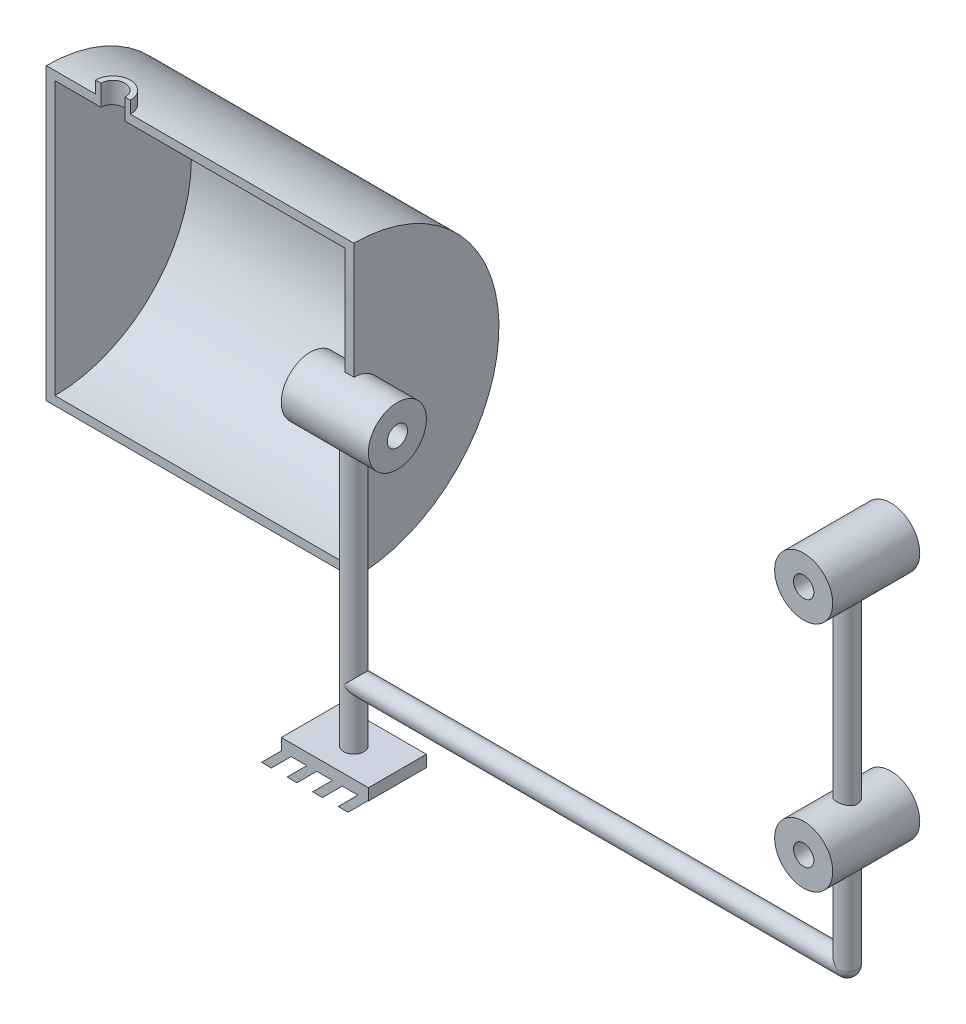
ISO-10303-21;
HEADER;
FILE_DESCRIPTION(('STEP AP214'),'2;1');
FILE_NAME('part.step','',(''),(''),'','','');
FILE_SCHEMA(('AUTOMOTIVE_DESIGN { 1 0 10303 214 1 1 1 1 }'));
ENDSEC;
DATA;
#1=APPLICATION_CONTEXT('core data for automotive mechanical design processes');
#2=APPLICATION_PROTOCOL_DEFINITION('international standard','automotive_design',2000,#1);
#3=PRODUCT_CONTEXT('',#1,'mechanical');
#4=PRODUCT('Part','Part','',(#3));
#5=PRODUCT_RELATED_PRODUCT_CATEGORY('part','',(#4));
#6=PRODUCT_DEFINITION_FORMATION('','',#4);
#7=PRODUCT_DEFINITION_CONTEXT('part definition',#1,'design');
#8=PRODUCT_DEFINITION('design','',#6,#7);
#9=PRODUCT_DEFINITION_SHAPE('','',#8);
#10=(LENGTH_UNIT() NAMED_UNIT(*) SI_UNIT(.MILLI.,.METRE.));
#11=(NAMED_UNIT(*) PLANE_ANGLE_UNIT() SI_UNIT($,.RADIAN.));
#12=(NAMED_UNIT(*) SI_UNIT($,.STERADIAN.) SOLID_ANGLE_UNIT());
#13=UNCERTAINTY_MEASURE_WITH_UNIT(LENGTH_MEASURE(1.E-05),#10,'distance_accuracy_value','');
#14=(GEOMETRIC_REPRESENTATION_CONTEXT(3) GLOBAL_UNCERTAINTY_ASSIGNED_CONTEXT((#13)) GLOBAL_UNIT_ASSIGNED_CONTEXT((#10,
#11,#12)) REPRESENTATION_CONTEXT('',''));
#15=CARTESIAN_POINT('',(0.,0.,0.));
#16=DIRECTION('',(0.,0.,1.));
#17=DIRECTION('',(1.,0.,0.));
#18=AXIS2_PLACEMENT_3D('',#15,#16,#17);
#19=CARTESIAN_POINT('',(15.,-104.,-10.));
#20=DIRECTION('',(0.,1.,0.));
#21=DIRECTION('',(0.,0.,1.));
#22=AXIS2_PLACEMENT_3D('',#19,#20,#21);
#23=PLANE('',#22);
#24=DIRECTION('',(1.,0.,0.));
#25=VECTOR('',#24,1.);
#26=CARTESIAN_POINT('',(15.,-104.,-10.));
#27=LINE('',#26,#25);
#28=CARTESIAN_POINT('',(6.00569821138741,-104.,-10.));
#29=VERTEX_POINT('',#28);
#30=CARTESIAN_POINT('',(11.4,-104.,-10.));
#31=VERTEX_POINT('',#30);
#32=EDGE_CURVE('E464',#29,#31,#27,.T.);
#33=ORIENTED_EDGE('',*,*,#32,.T.);
#34=DIRECTION('',(0.,0.,1.));
#35=VECTOR('',#34,1.);
#36=CARTESIAN_POINT('',(11.4,-104.,-22.2794195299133));
#37=LINE('',#36,#35);
#38=CARTESIAN_POINT('',(11.4,-104.,10.));
#39=VERTEX_POINT('',#38);
#40=EDGE_CURVE('E63',#31,#39,#37,.T.);
#41=ORIENTED_EDGE('',*,*,#40,.T.);
#42=DIRECTION('',(-1.,0.,0.));
#43=VECTOR('',#42,1.);
#44=CARTESIAN_POINT('',(15.,-104.,10.));
#45=LINE('',#44,#43);
#46=CARTESIAN_POINT('',(6.0056982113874,-104.,10.));
#47=VERTEX_POINT('',#46);
#48=EDGE_CURVE('E49',#39,#47,#45,.T.);
#49=ORIENTED_EDGE('',*,*,#48,.T.);
#50=DIRECTION('',(0.,0.,1.));
#51=VECTOR('',#50,1.);
#52=CARTESIAN_POINT('',(6.00569821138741,-104.,-22.2794195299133));
#53=LINE('',#52,#51);
#54=EDGE_CURVE('E1067',#29,#47,#53,.T.);
#55=ORIENTED_EDGE('',*,*,#54,.F.);
#56=EDGE_LOOP('',(#33,#41,#49,#55));
#57=FACE_BOUND('',#56,.T.);
#58=ADVANCED_FACE('F44',(#57),#23,.F.);
#59=CARTESIAN_POINT('',(-2.7943017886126,-104.,-10.));
#60=VERTEX_POINT('',#59);
#61=CARTESIAN_POINT('',(2.6,-104.,-10.));
#62=VERTEX_POINT('',#61);
#63=EDGE_CURVE('E407',#60,#62,#27,.T.);
#64=ORIENTED_EDGE('',*,*,#63,.T.);
#65=DIRECTION('',(0.,0.,1.));
#66=VECTOR('',#65,1.);
#67=CARTESIAN_POINT('',(2.6,-104.,-22.2794195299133));
#68=LINE('',#67,#66);
#69=CARTESIAN_POINT('',(2.6,-104.,10.));
#70=VERTEX_POINT('',#69);
#71=EDGE_CURVE('E1056',#62,#70,#68,.T.);
#72=ORIENTED_EDGE('',*,*,#71,.T.);
#73=CARTESIAN_POINT('',(-2.7943017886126,-104.,10.));
#74=VERTEX_POINT('',#73);
#75=EDGE_CURVE('E477',#70,#74,#45,.T.);
#76=ORIENTED_EDGE('',*,*,#75,.T.);
#77=DIRECTION('',(0.,0.,1.));
#78=VECTOR('',#77,1.);
#79=CARTESIAN_POINT('',(-2.7943017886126,-104.,-22.2794195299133));
#80=LINE('',#79,#78);
#81=EDGE_CURVE('E422',#60,#74,#80,.T.);
#82=ORIENTED_EDGE('',*,*,#81,.F.);
#83=EDGE_LOOP('',(#64,#72,#76,#82));
#84=FACE_BOUND('',#83,.T.);
#85=ADVANCED_FACE('F377',(#84),#23,.F.);
#86=CARTESIAN_POINT('',(-11.5943017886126,-104.,-10.));
#87=VERTEX_POINT('',#86);
#88=CARTESIAN_POINT('',(-6.19999999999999,-104.,-10.));
#89=VERTEX_POINT('',#88);
#90=EDGE_CURVE('E397',#87,#89,#27,.T.);
#91=ORIENTED_EDGE('',*,*,#90,.T.);
#92=DIRECTION('',(0.,0.,1.));
#93=VECTOR('',#92,1.);
#94=CARTESIAN_POINT('',(-6.2,-104.,-22.2794195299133));
#95=LINE('',#94,#93);
#96=CARTESIAN_POINT('',(-6.2,-104.,10.));
#97=VERTEX_POINT('',#96);
#98=EDGE_CURVE('E400',#89,#97,#95,.T.);
#99=ORIENTED_EDGE('',*,*,#98,.T.);
#100=CARTESIAN_POINT('',(-11.5943017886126,-104.,10.));
#101=VERTEX_POINT('',#100);
#102=EDGE_CURVE('E465',#97,#101,#45,.T.);
#103=ORIENTED_EDGE('',*,*,#102,.T.);
#104=DIRECTION('',(0.,0.,1.));
#105=VECTOR('',#104,1.);
#106=CARTESIAN_POINT('',(-11.5943017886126,-104.,-22.2794195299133));
#107=LINE('',#106,#105);
#108=EDGE_CURVE('E403',#87,#101,#107,.T.);
#109=ORIENTED_EDGE('',*,*,#108,.F.);
#110=EDGE_LOOP('',(#91,#99,#103,#109));
#111=FACE_BOUND('',#110,.T.);
#112=ADVANCED_FACE('F383',(#111),#23,.F.);
#113=CARTESIAN_POINT('',(15.,-104.,10.));
#114=VERTEX_POINT('',#113);
#115=CARTESIAN_POINT('',(14.8056982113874,-104.,10.));
#116=VERTEX_POINT('',#115);
#117=EDGE_CURVE('E71',#114,#116,#45,.T.);
#118=ORIENTED_EDGE('',*,*,#117,.T.);
#119=DIRECTION('',(0.,0.,1.));
#120=VECTOR('',#119,1.);
#121=CARTESIAN_POINT('',(14.8056982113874,-104.,-22.2794195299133));
#122=LINE('',#121,#120);
#123=CARTESIAN_POINT('',(14.8056982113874,-104.,-10.));
#124=VERTEX_POINT('',#123);
#125=EDGE_CURVE('E1106',#124,#116,#122,.T.);
#126=ORIENTED_EDGE('',*,*,#125,.F.);
#127=CARTESIAN_POINT('',(15.,-104.,-10.));
#128=VERTEX_POINT('',#127);
#129=EDGE_CURVE('E476',#124,#128,#27,.T.);
#130=ORIENTED_EDGE('',*,*,#129,.T.);
#131=DIRECTION('',(0.,0.,1.));
#132=VECTOR('',#131,1.);
#133=CARTESIAN_POINT('',(15.,-104.,10.));
#134=LINE('',#133,#132);
#135=EDGE_CURVE('E480',#128,#114,#134,.T.);
#136=ORIENTED_EDGE('',*,*,#135,.T.);
#137=EDGE_LOOP('',(#118,#126,#130,#136));
#138=FACE_BOUND('',#137,.T.);
#139=ADVANCED_FACE('F379',(#138),#23,.F.);
#140=CARTESIAN_POINT('',(170.,-83.5,0.));
#141=DIRECTION('',(0.,-1.,0.));
#142=DIRECTION('',(0.,0.,-1.));
#143=AXIS2_PLACEMENT_3D('',#140,#141,#142);
#144=CYLINDRICAL_SURFACE('',#143,3.5);
#145=CARTESIAN_POINT('',(170.,-80.,0.));
#146=DIRECTION('',(-0.707106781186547,-0.707106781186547,0.));
#147=DIRECTION('',(-0.707106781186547,0.707106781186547,0.));
#148=AXIS2_PLACEMENT_3D('',#145,#146,#147);
#149=ELLIPSE('',#148,4.94974746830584,3.5);
#150=CARTESIAN_POINT('',(170.,-80.,3.5));
#151=VERTEX_POINT('',#150);
#152=CARTESIAN_POINT('',(170.,-80.,-3.5));
#153=VERTEX_POINT('',#152);
#154=EDGE_CURVE('E257',#151,#153,#149,.T.);
#155=ORIENTED_EDGE('',*,*,#154,.F.);
#156=CARTESIAN_POINT('',(170.,-80.,0.));
#157=DIRECTION('',(0.,-1.,0.));
#158=DIRECTION('',(0.,0.,-1.));
#159=AXIS2_PLACEMENT_3D('',#156,#157,#158);
#160=CIRCLE('',#159,3.5);
#161=EDGE_CURVE('E262',#153,#151,#160,.T.);
#162=ORIENTED_EDGE('',*,*,#161,.F.);
#163=EDGE_LOOP('',(#155,#162));
#164=FACE_BOUND('',#163,.T.);
#165=CARTESIAN_POINT('',(170.,-50.,-3.5));
#166=CARTESIAN_POINT('',(170.190419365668,-50.000002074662,-3.5000029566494));
#167=CARTESIAN_POINT('',(170.380817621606,-49.9945119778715,-3.48441032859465));
#168=CARTESIAN_POINT('',(170.755973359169,-49.9731545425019,-3.42266620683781));
#169=CARTESIAN_POINT('',(170.940730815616,-49.9572871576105,-3.37651457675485));
#170=CARTESIAN_POINT('',(171.299142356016,-49.9168912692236,-3.25545106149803));
#171=CARTESIAN_POINT('',(171.472815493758,-49.8923781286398,-3.18059017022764));
#172=CARTESIAN_POINT('',(171.805136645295,-49.8371689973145,-3.00447488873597));
#173=CARTESIAN_POINT('',(171.963781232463,-49.8064716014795,-2.90321449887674));
#174=CARTESIAN_POINT('',(172.267525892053,-49.7408061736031,-2.67317148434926));
#175=CARTESIAN_POINT('',(172.41198196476,-49.7057284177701,-2.54357008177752));
#176=CARTESIAN_POINT('',(172.677611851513,-49.6358339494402,-2.26226333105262));
#177=CARTESIAN_POINT('',(172.79877980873,-49.6010173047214,-2.11055243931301));
#178=CARTESIAN_POINT('',(173.018229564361,-49.534353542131,-1.7833453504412));
#179=CARTESIAN_POINT('',(173.115646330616,-49.5026385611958,-1.60723944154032));
#180=CARTESIAN_POINT('',(173.279199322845,-49.4474524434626,-1.23985540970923));
#181=CARTESIAN_POINT('',(173.345346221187,-49.4239784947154,-1.0485824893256));
#182=CARTESIAN_POINT('',(173.442016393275,-49.3890943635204,-0.663656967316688));
#183=CARTESIAN_POINT('',(173.473755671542,-49.3772738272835,-0.470348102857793));
#184=CARTESIAN_POINT('',(173.504511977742,-49.3658257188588,-0.0808148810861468));
#185=CARTESIAN_POINT('',(173.503540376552,-49.3661939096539,0.115408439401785));
#186=CARTESIAN_POINT('',(173.469840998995,-49.3787242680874,0.494549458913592));
#187=CARTESIAN_POINT('',(173.438737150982,-49.3902833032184,0.677634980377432));
#188=CARTESIAN_POINT('',(173.348319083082,-49.4229000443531,1.03580240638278));
#189=CARTESIAN_POINT('',(173.289001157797,-49.4439589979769,1.21088325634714));
#190=CARTESIAN_POINT('',(173.142843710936,-49.4936061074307,1.55161236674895));
#191=CARTESIAN_POINT('',(173.055546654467,-49.5223179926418,1.71704555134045));
#192=CARTESIAN_POINT('',(172.856226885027,-49.5839881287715,2.03141194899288));
#193=CARTESIAN_POINT('',(172.744196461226,-49.616947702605,2.18033999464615));
#194=CARTESIAN_POINT('',(172.490933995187,-49.6857324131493,2.46654322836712));
#195=CARTESIAN_POINT('',(172.348386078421,-49.7216129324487,2.60264324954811));
#196=CARTESIAN_POINT('',(172.042056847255,-49.7905374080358,2.84932987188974));
#197=CARTESIAN_POINT('',(171.878273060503,-49.8235810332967,2.95991349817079));
#198=CARTESIAN_POINT('',(171.531434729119,-49.8836231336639,3.15350599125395));
#199=CARTESIAN_POINT('',(171.34817380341,-49.9105448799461,3.23617056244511));
#200=CARTESIAN_POINT('',(170.969175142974,-49.9547488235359,3.36912230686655));
#201=CARTESIAN_POINT('',(170.773442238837,-49.9720347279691,3.41942193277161));
#202=CARTESIAN_POINT('',(170.384982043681,-49.9943906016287,3.48406581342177));
#203=CARTESIAN_POINT('',(170.192549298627,-49.9999988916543,3.49999580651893));
#204=CARTESIAN_POINT('',(169.807703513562,-50.0000011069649,3.50000418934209));
#205=CARTESIAN_POINT('',(169.615290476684,-49.9943971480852,3.48408858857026));
#206=CARTESIAN_POINT('',(169.242487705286,-49.972960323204,3.42209465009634));
#207=CARTESIAN_POINT('',(169.061910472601,-49.9574663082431,3.37701486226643));
#208=CARTESIAN_POINT('',(168.710974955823,-49.9181459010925,3.25924618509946));
#209=CARTESIAN_POINT('',(168.540617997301,-49.894318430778,3.18655372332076));
#210=CARTESIAN_POINT('',(168.209693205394,-49.8399042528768,3.01340991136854));
#211=CARTESIAN_POINT('',(168.049526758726,-49.8091487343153,2.91224601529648));
#212=CARTESIAN_POINT('',(167.747942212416,-49.7443351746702,2.68585482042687));
#213=CARTESIAN_POINT('',(167.606530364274,-49.7102760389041,2.56061953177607));
#214=CARTESIAN_POINT('',(167.339046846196,-49.6405083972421,2.28219979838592));
#215=CARTESIAN_POINT('',(167.214105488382,-49.6048031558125,2.12792589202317));
#216=CARTESIAN_POINT('',(166.991712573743,-49.537491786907,1.79985410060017));
#217=CARTESIAN_POINT('',(166.894261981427,-49.5058858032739,1.62605553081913));
#218=CARTESIAN_POINT('',(166.729890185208,-49.4506055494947,1.26333270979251));
#219=CARTESIAN_POINT('',(166.662969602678,-49.4269314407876,1.07440815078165));
#220=CARTESIAN_POINT('',(166.562248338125,-49.3906754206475,0.686934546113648));
#221=CARTESIAN_POINT('',(166.528430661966,-49.3780878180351,0.488390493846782));
#222=CARTESIAN_POINT('',(166.496280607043,-49.3661206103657,0.0993796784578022));
#223=CARTESIAN_POINT('',(166.496052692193,-49.3660354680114,-0.0909102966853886));
#224=CARTESIAN_POINT('',(166.526348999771,-49.3773132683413,-0.468662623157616));
#225=CARTESIAN_POINT('',(166.556871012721,-49.3886753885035,-0.656125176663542));
#226=CARTESIAN_POINT('',(166.646403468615,-49.421016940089,-1.01855095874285));
#227=CARTESIAN_POINT('',(166.704738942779,-49.4417679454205,-1.19370296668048));
#228=CARTESIAN_POINT('',(166.847678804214,-49.4904448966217,-1.53185809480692));
#229=CARTESIAN_POINT('',(166.932289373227,-49.5183725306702,-1.69485834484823));
#230=CARTESIAN_POINT('',(167.130029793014,-49.5798987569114,-2.01243457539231));
#231=CARTESIAN_POINT('',(167.244317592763,-49.6137028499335,-2.16624940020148));
#232=CARTESIAN_POINT('',(167.496275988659,-49.6823756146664,-2.45312762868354));
#233=CARTESIAN_POINT('',(167.63395351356,-49.7172445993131,-2.58618486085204));
#234=CARTESIAN_POINT('',(167.936146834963,-49.7859866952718,-2.83378378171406));
#235=CARTESIAN_POINT('',(168.101586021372,-49.8197459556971,-2.94723445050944));
#236=CARTESIAN_POINT('',(168.450332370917,-49.8807802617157,-3.14462349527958));
#237=CARTESIAN_POINT('',(168.63363716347,-49.9080561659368,-3.22856577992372));
#238=CARTESIAN_POINT('',(169.010970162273,-49.952762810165,-3.36325721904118));
#239=CARTESIAN_POINT('',(169.204860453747,-49.9702971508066,-3.41435660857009));
#240=CARTESIAN_POINT('',(169.599176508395,-49.9939126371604,-3.48272048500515));
#241=CARTESIAN_POINT('',(169.79959994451,-49.9999978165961,-3.49999688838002));
#242=CARTESIAN_POINT('',(170.,-50.,-3.5));
#243=B_SPLINE_CURVE_WITH_KNOTS('',3,(#165,#166,#167,#168,#169,#170,#171,#172,#173,#174,#175,
#176,#177,#178,#179,#180,#181,#182,#183,#184,#185,#186,#187,#188,#189,#190,#191,#192,#193,#194,
#195,#196,#197,#198,#199,#200,#201,#202,#203,#204,#205,#206,#207,#208,#209,#210,#211,#212,#213,
#214,#215,#216,#217,#218,#219,#220,#221,#222,#223,#224,#225,#226,#227,#228,#229,#230,#231,#232,
#233,#234,#235,#236,#237,#238,#239,#240,#241,#242),.UNSPECIFIED.,.T.,.F.,(4,2,2,2,2,2,2,2,2,2,2,
2,2,2,2,2,2,2,2,2,2,2,2,2,2,2,2,2,2,2,2,2,2,2,2,2,2,2,4),(0.,0.570519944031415,1.14104243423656,
1.71055621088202,2.28019953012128,2.86921290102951,3.45837421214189,4.06655384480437,
4.67452575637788,5.26023033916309,5.84573132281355,6.40133800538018,6.95701767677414,
7.52229238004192,8.08774356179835,8.68595781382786,9.28424177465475,9.88965514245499,
10.4948354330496,11.071437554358,11.6479308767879,12.2056613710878,12.7634640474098,
13.336703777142,13.9101341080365,14.5124257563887,15.1147385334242,15.7170635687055,
16.319079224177,16.8871081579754,17.4550962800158,18.0099524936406,18.5649393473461,
19.1461307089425,19.7274945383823,20.3347978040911,20.9420205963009,21.542655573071,
22.1430788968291),.UNSPECIFIED.);
#244=CARTESIAN_POINT('',(170.,-50.,-3.5));
#245=VERTEX_POINT('',#244);
#246=EDGE_CURVE('E498',#245,#245,#243,.T.);
#247=ORIENTED_EDGE('',*,*,#246,.T.);
#248=EDGE_LOOP('',(#247));
#249=FACE_BOUND('',#248,.T.);
#250=ADVANCED_FACE('F259',(#164,#249),#144,.T.);
#251=CARTESIAN_POINT('',(0.,-100.,0.));
#252=DIRECTION('',(0.,1.,0.));
#253=DIRECTION('',(0.,0.,1.));
#254=AXIS2_PLACEMENT_3D('',#251,#252,#253);
#255=CYLINDRICAL_SURFACE('',#254,3.5);
#256=CARTESIAN_POINT('',(0.,-100.,0.));
#257=DIRECTION('',(0.,1.,0.));
#258=DIRECTION('',(0.,0.,1.));
#259=AXIS2_PLACEMENT_3D('',#256,#257,#258);
#260=CIRCLE('',#259,3.5);
#261=CARTESIAN_POINT('',(0.,-100.,3.5));
#262=VERTEX_POINT('',#261);
#263=EDGE_CURVE('E1118',#262,#262,#260,.F.);
#264=ORIENTED_EDGE('',*,*,#263,.F.);
#265=EDGE_LOOP('',(#264));
#266=FACE_BOUND('',#265,.T.);
#267=DIRECTION('',(0.,1.,0.));
#268=VECTOR('',#267,1.);
#269=CARTESIAN_POINT('',(-3.,-100.,-1.802775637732));
#270=LINE('',#269,#268);
#271=CARTESIAN_POINT('',(-3.,-9.836157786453,-1.802775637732));
#272=VERTEX_POINT('',#271);
#273=CARTESIAN_POINT('',(-3.,-46.9654128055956,-1.802775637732));
#274=VERTEX_POINT('',#273);
#275=EDGE_CURVE('E317',#272,#274,#270,.F.);
#276=ORIENTED_EDGE('',*,*,#275,.T.);
#277=CARTESIAN_POINT('',(0.,-46.8694996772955,3.5));
#278=CARTESIAN_POINT('',(0.196303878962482,-46.8695014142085,3.49999139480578));
#279=CARTESIAN_POINT('',(0.392743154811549,-46.8707462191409,3.48342937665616));
#280=CARTESIAN_POINT('',(0.7801915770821,-46.875591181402,3.4176012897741));
#281=CARTESIAN_POINT('',(0.971194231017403,-46.8791940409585,3.3682976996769));
#282=CARTESIAN_POINT('',(1.34210145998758,-46.8883447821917,3.23841578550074));
#283=CARTESIAN_POINT('',(1.5220120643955,-46.8938915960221,3.15785462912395));
#284=CARTESIAN_POINT('',(1.86571243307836,-46.9063039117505,2.96777372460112));
#285=CARTESIAN_POINT('',(2.02950574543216,-46.9131691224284,2.85826036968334));
#286=CARTESIAN_POINT('',(2.33670702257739,-46.9274607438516,2.61313672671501));
#287=CARTESIAN_POINT('',(2.48007695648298,-46.9348881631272,2.47747883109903));
#288=CARTESIAN_POINT('',(2.74203548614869,-46.9494580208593,2.18401681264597));
#289=CARTESIAN_POINT('',(2.86062302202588,-46.9566004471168,2.02621174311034));
#290=CARTESIAN_POINT('',(3.06977337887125,-46.969804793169,1.69271264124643));
#291=CARTESIAN_POINT('',(3.16030384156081,-46.9758654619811,1.51699826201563));
#292=CARTESIAN_POINT('',(3.31056319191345,-46.9862126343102,1.15281068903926));
#293=CARTESIAN_POINT('',(3.3702925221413,-46.9904991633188,0.964337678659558));
#294=CARTESIAN_POINT('',(3.45714613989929,-46.9968080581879,0.580356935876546));
#295=CARTESIAN_POINT('',(3.48433122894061,-46.9988346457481,0.384863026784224));
#296=CARTESIAN_POINT('',(3.50551255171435,-47.0004095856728,-0.00792281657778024));
#297=CARTESIAN_POINT('',(3.49950929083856,-46.9999579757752,-0.205214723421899));
#298=CARTESIAN_POINT('',(3.45453423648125,-46.9966309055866,-0.595584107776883));
#299=CARTESIAN_POINT('',(3.41562783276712,-46.9937602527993,-0.788669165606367));
#300=CARTESIAN_POINT('',(3.30605248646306,-46.9859236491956,-1.16556052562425));
#301=CARTESIAN_POINT('',(3.23538329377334,-46.9809576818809,-1.3493667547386));
#302=CARTESIAN_POINT('',(3.06421499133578,-46.96948105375,-1.70269181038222));
#303=CARTESIAN_POINT('',(2.96368643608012,-46.9629688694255,-1.8721963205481));
#304=CARTESIAN_POINT('',(2.73567443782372,-46.9491321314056,-2.19195003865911));
#305=CARTESIAN_POINT('',(2.60819056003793,-46.9418075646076,-2.34219893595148));
#306=CARTESIAN_POINT('',(2.32951782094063,-46.9271487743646,-2.61955843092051));
#307=CARTESIAN_POINT('',(2.178272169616,-46.9198145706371,-2.74661197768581));
#308=CARTESIAN_POINT('',(1.85656758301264,-46.9059810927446,-2.97353383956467));
#309=CARTESIAN_POINT('',(1.68610863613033,-46.8994818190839,-3.07340213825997));
#310=CARTESIAN_POINT('',(1.33077784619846,-46.888052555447,-3.24311556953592));
#311=CARTESIAN_POINT('',(1.14590470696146,-46.8831227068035,-3.31295799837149));
#312=CARTESIAN_POINT('',(0.767011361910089,-46.8753928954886,-3.42059619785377));
#313=CARTESIAN_POINT('',(0.57299130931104,-46.8725928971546,-3.45839250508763));
#314=CARTESIAN_POINT('',(0.181810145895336,-46.8694452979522,-3.50079386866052));
#315=CARTESIAN_POINT('',(-0.015342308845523,-46.8690918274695,-3.50547836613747));
#316=CARTESIAN_POINT('',(-0.407629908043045,-46.8708617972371,-3.48173098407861));
#317=CARTESIAN_POINT('',(-0.60276506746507,-46.8729852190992,-3.45329935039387));
#318=CARTESIAN_POINT('',(-0.985252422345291,-46.8794643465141,-3.36419289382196));
#319=CARTESIAN_POINT('',(-1.17261324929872,-46.8838175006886,-3.30355492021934));
#320=CARTESIAN_POINT('',(-1.53450039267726,-46.8942634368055,-3.15179446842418));
#321=CARTESIAN_POINT('',(-1.70902654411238,-46.9003562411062,-3.06067159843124));
#322=CARTESIAN_POINT('',(-2.040654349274,-46.9136091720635,-2.85032606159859));
#323=CARTESIAN_POINT('',(-2.19772225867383,-46.9207713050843,-2.73105032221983));
#324=CARTESIAN_POINT('',(-2.48963446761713,-46.9353489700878,-2.46786176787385));
#325=CARTESIAN_POINT('',(-2.62447846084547,-46.9427645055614,-2.32394861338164));
#326=CARTESIAN_POINT('',(-2.86838497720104,-46.9570307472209,-2.01522773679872));
#327=CARTESIAN_POINT('',(-2.97739598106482,-46.963880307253,-1.85037925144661));
#328=CARTESIAN_POINT('',(-3.16618905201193,-46.9762263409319,-1.50467111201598));
#329=CARTESIAN_POINT('',(-3.24597136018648,-46.9817228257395,-1.32381159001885));
#330=CARTESIAN_POINT('',(-3.37395330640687,-46.9907380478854,-0.951402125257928));
#331=CARTESIAN_POINT('',(-3.42218514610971,-46.9942588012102,-0.759863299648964));
#332=CARTESIAN_POINT('',(-3.48580234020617,-46.9989339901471,-0.371378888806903));
#333=CARTESIAN_POINT('',(-3.50118817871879,-47.0000884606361,-0.174433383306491));
#334=CARTESIAN_POINT('',(-3.49867145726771,-46.999901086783,0.218765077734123));
#335=CARTESIAN_POINT('',(-3.4808493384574,-46.9985652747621,0.415018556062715));
#336=CARTESIAN_POINT('',(-3.41258991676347,-46.993559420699,0.801737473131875));
#337=CARTESIAN_POINT('',(-3.36215256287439,-46.9898893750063,0.992202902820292));
#338=CARTESIAN_POINT('',(-3.23011388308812,-46.9806271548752,1.36194728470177));
#339=CARTESIAN_POINT('',(-3.14851353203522,-46.9750350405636,1.54122658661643));
#340=CARTESIAN_POINT('',(-2.95647504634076,-46.9625553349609,1.88355288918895));
#341=CARTESIAN_POINT('',(-2.84603750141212,-46.9556677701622,2.04660022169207));
#342=CARTESIAN_POINT('',(-2.59915872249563,-46.9413511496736,2.35224488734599));
#343=CARTESIAN_POINT('',(-2.46265838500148,-46.9339208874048,2.49479442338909));
#344=CARTESIAN_POINT('',(-2.16762671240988,-46.9193664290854,2.75501127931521));
#345=CARTESIAN_POINT('',(-2.00909002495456,-46.9122423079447,2.87267253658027));
#346=CARTESIAN_POINT('',(-1.67423716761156,-46.8990944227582,3.07989841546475));
#347=CARTESIAN_POINT('',(-1.49789333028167,-46.8930724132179,3.16941839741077));
#348=CARTESIAN_POINT('',(-1.13275709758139,-46.8828323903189,3.31746671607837));
#349=CARTESIAN_POINT('',(-0.943979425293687,-46.8786122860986,3.37603099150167));
#350=CARTESIAN_POINT('',(-0.628390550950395,-46.8735487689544,3.44544860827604));
#351=CARTESIAN_POINT('',(-0.503613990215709,-46.8720372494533,3.46587852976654));
#352=CARTESIAN_POINT('',(-0.252576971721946,-46.8700121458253,3.49315698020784));
#353=CARTESIAN_POINT('',(-0.126316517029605,-46.8694985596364,3.50000553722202));
#354=CARTESIAN_POINT('',(0.,-46.8694996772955,3.5));
#355=B_SPLINE_CURVE_WITH_KNOTS('',3,(#277,#278,#279,#280,#281,#282,#283,#284,#285,#286,#287,
#288,#289,#290,#291,#292,#293,#294,#295,#296,#297,#298,#299,#300,#301,#302,#303,#304,#305,#306,
#307,#308,#309,#310,#311,#312,#313,#314,#315,#316,#317,#318,#319,#320,#321,#322,#323,#324,#325,
#326,#327,#328,#329,#330,#331,#332,#333,#334,#335,#336,#337,#338,#339,#340,#341,#342,#343,#344,
#345,#346,#347,#348,#349,#350,#351,#352,#353,#354),.UNSPECIFIED.,.T.,.F.,(4,2,2,2,2,2,2,2,2,2,2,
2,2,2,2,2,2,2,2,2,2,2,2,2,2,2,2,2,2,2,2,2,2,2,2,2,2,2,4),(0.,0.588450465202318,1.17757645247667,
1.76637932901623,2.35505229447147,2.94480750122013,3.53458792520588,4.12504603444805,
4.71549565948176,5.3048404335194,5.89417623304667,6.48234356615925,7.070515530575,
7.65926945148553,8.24803286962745,8.83822544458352,9.4284183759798,10.0186644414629,
10.6089006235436,11.1977202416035,11.7865354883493,12.3746784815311,12.9628290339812,
13.5520973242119,14.1413737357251,14.7318156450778,15.3222526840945,15.912086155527,
16.5019109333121,17.0903088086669,17.6787076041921,18.2670879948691,18.8554563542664,
19.4451751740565,20.0350374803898,20.6258308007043,21.2159367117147,21.5945902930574,
21.9732430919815),.UNSPECIFIED.);
#356=CARTESIAN_POINT('',(-3.5,-47.,3.28199245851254E-13));
#357=VERTEX_POINT('',#356);
#358=EDGE_CURVE('E310',#274,#357,#355,.T.);
#359=ORIENTED_EDGE('',*,*,#358,.T.);
#360=DIRECTION('',(0.,1.,0.));
#361=VECTOR('',#360,1.);
#362=CARTESIAN_POINT('',(-3.5,-100.,6.98296267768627E-13));
#363=LINE('',#362,#361);
#364=CARTESIAN_POINT('',(-3.5,-50.,3.49148133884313E-13));
#365=VERTEX_POINT('',#364);
#366=EDGE_CURVE('E287',#365,#357,#363,.T.);
#367=ORIENTED_EDGE('',*,*,#366,.F.);
#368=CARTESIAN_POINT('',(0.,-49.877349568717,3.5));
#369=CARTESIAN_POINT('',(-0.196337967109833,-49.8773512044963,3.49999138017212));
#370=CARTESIAN_POINT('',(-0.392812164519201,-49.8785213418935,3.48342363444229));
#371=CARTESIAN_POINT('',(-0.780331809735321,-49.8830758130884,3.41757146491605));
#372=CARTESIAN_POINT('',(-0.971370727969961,-49.8864627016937,3.36824929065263));
#373=CARTESIAN_POINT('',(-1.34235067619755,-49.8950651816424,3.23831511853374));
#374=CARTESIAN_POINT('',(-1.52229764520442,-49.9002797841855,3.15772003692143));
#375=CARTESIAN_POINT('',(-1.86606356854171,-49.9119488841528,2.96755614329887));
#376=CARTESIAN_POINT('',(-2.02988612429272,-49.9184031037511,2.85799382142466));
#377=CARTESIAN_POINT('',(-2.33710181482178,-49.9318376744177,2.61278459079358));
#378=CARTESIAN_POINT('',(-2.48046107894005,-49.9388188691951,2.47709528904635));
#379=CARTESIAN_POINT('',(-2.74239042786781,-49.9525129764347,2.18357227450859));
#380=CARTESIAN_POINT('',(-2.86095946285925,-49.9592258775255,2.02573762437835));
#381=CARTESIAN_POINT('',(-3.07005006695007,-49.9716345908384,1.69220885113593));
#382=CARTESIAN_POINT('',(-3.1605431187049,-49.9773293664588,1.51649680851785));
#383=CARTESIAN_POINT('',(-3.31073048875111,-49.9870512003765,1.15232650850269));
#384=CARTESIAN_POINT('',(-3.37042520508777,-49.9910782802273,0.963868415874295));
#385=CARTESIAN_POINT('',(-3.45722605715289,-49.9970051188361,0.579886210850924));
#386=CARTESIAN_POINT('',(-3.48438592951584,-49.9989083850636,0.384374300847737));
#387=CARTESIAN_POINT('',(-3.50551213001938,-50.0003849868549,-0.00844197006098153));
#388=CARTESIAN_POINT('',(-3.49947891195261,-49.9999583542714,-0.2057463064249));
#389=CARTESIAN_POINT('',(-3.45443438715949,-49.9968261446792,-0.596182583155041));
#390=CARTESIAN_POINT('',(-3.4154808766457,-49.9941245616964,-0.789321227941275));
#391=CARTESIAN_POINT('',(-3.30579126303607,-49.986751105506,-1.16631187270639));
#392=CARTESIAN_POINT('',(-3.23505493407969,-49.9820792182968,-1.35016380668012));
#393=CARTESIAN_POINT('',(-3.06374251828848,-49.971284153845,-1.70354716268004));
#394=CARTESIAN_POINT('',(-2.96314034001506,-49.9651597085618,-1.87306589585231));
#395=CARTESIAN_POINT('',(-2.73497091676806,-49.9521484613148,-2.19283229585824));
#396=CARTESIAN_POINT('',(-2.60740328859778,-49.945261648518,-2.34307968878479));
#397=CARTESIAN_POINT('',(-2.32859794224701,-49.9314829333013,-2.62037596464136));
#398=CARTESIAN_POINT('',(-2.17731004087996,-49.9245910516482,-2.74737439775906));
#399=CARTESIAN_POINT('',(-1.85553416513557,-49.9115939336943,-2.97417850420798));
#400=CARTESIAN_POINT('',(-1.68504618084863,-49.9054886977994,-3.07398416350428));
#401=CARTESIAN_POINT('',(-1.32967649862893,-49.8947545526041,-3.2435665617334));
#402=CARTESIAN_POINT('',(-1.14479370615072,-49.8901257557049,-3.31334101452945));
#403=CARTESIAN_POINT('',(-0.765897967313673,-49.8828703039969,-3.42084470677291));
#404=CARTESIAN_POINT('',(-0.571885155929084,-49.8802436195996,-3.45857441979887));
#405=CARTESIAN_POINT('',(-0.180677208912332,-49.8772941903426,-3.50085444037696));
#406=CARTESIAN_POINT('',(0.0165103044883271,-49.8769665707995,-3.50547494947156));
#407=CARTESIAN_POINT('',(0.408857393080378,-49.8786394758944,-3.48158897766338));
#408=CARTESIAN_POINT('',(0.604016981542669,-49.8806399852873,-3.4530827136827));
#409=CARTESIAN_POINT('',(0.986568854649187,-49.8867392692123,-3.36381076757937));
#410=CARTESIAN_POINT('',(1.17396875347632,-49.8908359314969,-3.30307755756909));
#411=CARTESIAN_POINT('',(1.53591694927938,-49.9006641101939,-3.15110864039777));
#412=CARTESIAN_POINT('',(1.71046510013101,-49.9063956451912,-3.05987258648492));
#413=CARTESIAN_POINT('',(2.04207709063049,-49.9188595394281,-2.84930901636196));
#414=CARTESIAN_POINT('',(2.19911105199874,-49.9255935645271,-2.72993454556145));
#415=CARTESIAN_POINT('',(2.49093573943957,-49.9392978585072,-2.4665509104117));
#416=CARTESIAN_POINT('',(2.62572619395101,-49.9462681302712,-2.3225414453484));
#417=CARTESIAN_POINT('',(2.86947560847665,-49.9596738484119,-2.01367317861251));
#418=CARTESIAN_POINT('',(2.97838908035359,-49.9661083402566,-1.84877843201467));
#419=CARTESIAN_POINT('',(3.16698133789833,-49.9777037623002,-1.50300056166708));
#420=CARTESIAN_POINT('',(3.24666034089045,-49.9828647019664,-1.32211755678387));
#421=CARTESIAN_POINT('',(3.37444306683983,-49.991327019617,-0.949663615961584));
#422=CARTESIAN_POINT('',(3.42257536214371,-49.994630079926,-0.758102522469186));
#423=CARTESIAN_POINT('',(3.4859918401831,-49.9990112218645,-0.369593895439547));
#424=CARTESIAN_POINT('',(3.50127644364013,-50.0000893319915,-0.172646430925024));
#425=CARTESIAN_POINT('',(3.49855934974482,-49.9998991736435,0.220594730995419));
#426=CARTESIAN_POINT('',(3.48062874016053,-49.9986359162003,0.416888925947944));
#427=CARTESIAN_POINT('',(3.41213787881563,-49.9939149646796,0.803671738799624));
#428=CARTESIAN_POINT('',(3.36157757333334,-49.9904572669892,0.994160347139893));
#429=CARTESIAN_POINT('',(3.22927932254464,-49.9817358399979,1.3639332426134));
#430=CARTESIAN_POINT('',(3.14754202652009,-49.9764721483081,1.54321776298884));
#431=CARTESIAN_POINT('',(2.95521910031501,-49.9647290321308,1.88552933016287));
#432=CARTESIAN_POINT('',(2.84463412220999,-49.958249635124,2.04855674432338));
#433=CARTESIAN_POINT('',(2.59748999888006,-49.9447869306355,2.35408850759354));
#434=CARTESIAN_POINT('',(2.46087888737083,-49.9378026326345,2.49655077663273));
#435=CARTESIAN_POINT('',(2.16564126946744,-49.9241254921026,2.75657317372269));
#436=CARTESIAN_POINT('',(2.00700940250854,-49.9174327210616,2.87412722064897));
#437=CARTESIAN_POINT('',(1.6720111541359,-49.9050857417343,3.08110643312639));
#438=CARTESIAN_POINT('',(1.49561948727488,-49.899433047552,3.17049072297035));
#439=CARTESIAN_POINT('',(1.13041819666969,-49.8898252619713,3.31826310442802));
#440=CARTESIAN_POINT('',(0.941623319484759,-49.8858681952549,3.3766872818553));
#441=CARTESIAN_POINT('',(0.626405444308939,-49.881130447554,3.44579537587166));
#442=CARTESIAN_POINT('',(0.502016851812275,-49.8797190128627,3.46609558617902));
#443=CARTESIAN_POINT('',(0.251770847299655,-49.8778280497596,3.49320065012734));
#444=CARTESIAN_POINT('',(0.125913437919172,-49.877348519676,3.50000552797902));
#445=CARTESIAN_POINT('',(0.,-49.877349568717,3.5));
#446=B_SPLINE_CURVE_WITH_KNOTS('',3,(#368,#369,#370,#371,#372,#373,#374,#375,#376,#377,#378,
#379,#380,#381,#382,#383,#384,#385,#386,#387,#388,#389,#390,#391,#392,#393,#394,#395,#396,#397,
#398,#399,#400,#401,#402,#403,#404,#405,#406,#407,#408,#409,#410,#411,#412,#413,#414,#415,#416,
#417,#418,#419,#420,#421,#422,#423,#424,#425,#426,#427,#428,#429,#430,#431,#432,#433,#434,#435,
#436,#437,#438,#439,#440,#441,#442,#443,#444,#445),.UNSPECIFIED.,.T.,.F.,(4,2,2,2,2,2,2,2,2,2,2,
2,2,2,2,2,2,2,2,2,2,2,2,2,2,2,2,2,2,2,2,2,2,2,2,2,2,2,4),(0.,0.588554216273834,1.17778793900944,
1.76670337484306,2.35548697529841,2.94523409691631,3.53500618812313,4.12537537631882,
4.71573693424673,5.30512206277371,5.89449913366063,6.48284361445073,7.07119227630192,
7.66005645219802,8.24892899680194,8.83906461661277,9.42920054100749,10.0193813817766,
10.6095535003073,11.1984739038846,11.7873904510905,12.3757147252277,12.9640456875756,
13.5533654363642,14.1426923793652,14.7330477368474,15.3233987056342,15.9132142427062,
16.5030222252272,17.0915693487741,17.6801174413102,18.2686532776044,18.8571758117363,
19.4468860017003,20.0367399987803,20.6274460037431,21.2174619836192,21.5949081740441,
21.9723536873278),.UNSPECIFIED.);
#447=CARTESIAN_POINT('',(0.,-49.8773495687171,-3.5));
#448=VERTEX_POINT('',#447);
#449=EDGE_CURVE('E303',#365,#448,#446,.T.);
#450=ORIENTED_EDGE('',*,*,#449,.T.);
#451=DIRECTION('',(0.,1.,0.));
#452=VECTOR('',#451,1.);
#453=CARTESIAN_POINT('',(0.,-100.,-3.5));
#454=LINE('',#453,#452);
#455=CARTESIAN_POINT('',(0.,-9.3674969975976,-3.5));
#456=VERTEX_POINT('',#455);
#457=EDGE_CURVE('E269',#448,#456,#454,.T.);
#458=ORIENTED_EDGE('',*,*,#457,.T.);
#459=CARTESIAN_POINT('',(0.,-9.3674969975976,3.5));
#460=CARTESIAN_POINT('',(0.190015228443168,-9.36749440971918,3.50000305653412));
#461=CARTESIAN_POINT('',(0.380009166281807,-9.37334161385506,3.48447405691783));
#462=CARTESIAN_POINT('',(0.754329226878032,-9.3959610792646,3.42300568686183));
#463=CARTESIAN_POINT('',(0.938654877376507,-9.41273424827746,3.37706378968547));
#464=CARTESIAN_POINT('',(1.29614668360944,-9.45507797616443,3.25661257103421));
#465=CARTESIAN_POINT('',(1.46933564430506,-9.48062983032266,3.18216395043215));
#466=CARTESIAN_POINT('',(1.80082676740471,-9.53762356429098,3.00702321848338));
#467=CARTESIAN_POINT('',(1.95912513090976,-9.56906694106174,2.90632443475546));
#468=CARTESIAN_POINT('',(2.26317861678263,-9.63582342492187,2.67688293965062));
#469=CARTESIAN_POINT('',(2.40819784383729,-9.67123996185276,2.54719487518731));
#470=CARTESIAN_POINT('',(2.67493749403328,-9.74108253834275,2.26546916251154));
#471=CARTESIAN_POINT('',(2.79665372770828,-9.77550839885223,2.11342750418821));
#472=CARTESIAN_POINT('',(3.01675012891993,-9.84070055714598,1.78585018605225));
#473=CARTESIAN_POINT('',(3.11434809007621,-9.87133119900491,1.60975957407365));
#474=CARTESIAN_POINT('',(3.27823961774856,-9.92425360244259,1.2424014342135));
#475=CARTESIAN_POINT('',(3.34454254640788,-9.94654785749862,1.05113846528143));
#476=CARTESIAN_POINT('',(3.44143357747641,-9.97955234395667,0.666588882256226));
#477=CARTESIAN_POINT('',(3.47328474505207,-9.9906711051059,0.473656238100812));
#478=CARTESIAN_POINT('',(3.50439617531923,-10.0015281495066,0.0848856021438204));
#479=CARTESIAN_POINT('',(3.50366568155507,-10.0012696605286,-0.110951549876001));
#480=CARTESIAN_POINT('',(3.47041038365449,-9.98967164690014,-0.490988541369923));
#481=CARTESIAN_POINT('',(3.43925996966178,-9.97881113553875,-0.675325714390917));
#482=CARTESIAN_POINT('',(3.34833697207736,-9.94784117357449,-1.03596846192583));
#483=CARTESIAN_POINT('',(3.28856240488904,-9.92773108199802,-1.21227347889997));
#484=CARTESIAN_POINT('',(3.14135069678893,-9.87993869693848,-1.55471483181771));
#485=CARTESIAN_POINT('',(3.05354374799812,-9.85215588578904,-1.72067758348));
#486=CARTESIAN_POINT('',(2.85307254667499,-9.79187924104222,-2.03590117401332));
#487=CARTESIAN_POINT('',(2.74040091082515,-9.75938400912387,-2.18515703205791));
#488=CARTESIAN_POINT('',(2.48658785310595,-9.69110123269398,-2.47087991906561));
#489=CARTESIAN_POINT('',(2.3442779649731,-9.65523032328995,-2.60629061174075));
#490=CARTESIAN_POINT('',(2.03869601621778,-9.5856236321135,-2.85168878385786));
#491=CARTESIAN_POINT('',(1.87542000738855,-9.55188825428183,-2.9616714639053));
#492=CARTESIAN_POINT('',(1.52887993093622,-9.48988823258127,-3.15476153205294));
#493=CARTESIAN_POINT('',(1.34532137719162,-9.46172720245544,-3.23737626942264));
#494=CARTESIAN_POINT('',(0.96565865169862,-9.41525954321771,-3.37014757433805));
#495=CARTESIAN_POINT('',(0.769560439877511,-9.39694827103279,-3.42031943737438));
#496=CARTESIAN_POINT('',(0.380703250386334,-9.37332105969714,-3.48453330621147));
#497=CARTESIAN_POINT('',(0.188253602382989,-9.36741082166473,-3.50022937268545));
#498=CARTESIAN_POINT('',(-0.196579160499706,-9.36758502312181,-3.49976567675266));
#499=CARTESIAN_POINT('',(-0.388962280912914,-9.37366698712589,-3.48361248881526));
#500=CARTESIAN_POINT('',(-0.760318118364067,-9.39654335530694,-3.42140083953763));
#501=CARTESIAN_POINT('',(-0.9395208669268,-9.41290826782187,-3.37654009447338));
#502=CARTESIAN_POINT('',(-1.28780306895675,-9.45401972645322,-3.25965068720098));
#503=CARTESIAN_POINT('',(-1.4568806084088,-9.47876785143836,-3.18761690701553));
#504=CARTESIAN_POINT('',(-1.78650944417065,-9.53489951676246,-3.01564515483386));
#505=CARTESIAN_POINT('',(-1.94657352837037,-9.56648051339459,-2.91483956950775));
#506=CARTESIAN_POINT('',(-2.24810844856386,-9.63235686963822,-2.68914500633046));
#507=CARTESIAN_POINT('',(-2.38957324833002,-9.66665310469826,-2.56424824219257));
#508=CARTESIAN_POINT('',(-2.6577872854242,-9.73633119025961,-2.28593247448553));
#509=CARTESIAN_POINT('',(-2.78333219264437,-9.77167190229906,-2.13133888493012));
#510=CARTESIAN_POINT('',(-3.00680180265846,-9.83765372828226,-1.80240593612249));
#511=CARTESIAN_POINT('',(-3.10472714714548,-9.86829495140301,-1.62806703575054));
#512=CARTESIAN_POINT('',(-3.26935426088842,-9.92132136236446,-1.26521616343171));
#513=CARTESIAN_POINT('',(-3.33622971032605,-9.94375232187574,-1.07679004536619));
#514=CARTESIAN_POINT('',(-3.43702558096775,-9.97801936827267,-0.690414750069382));
#515=CARTESIAN_POINT('',(-3.47095926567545,-9.98985971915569,-0.492469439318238));
#516=CARTESIAN_POINT('',(-3.50362041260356,-10.0012572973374,-0.103636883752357));
#517=CARTESIAN_POINT('',(-3.50406912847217,-10.0014150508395,0.0870896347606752));
#518=CARTESIAN_POINT('',(-3.47406390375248,-9.99094200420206,0.465775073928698));
#519=CARTESIAN_POINT('',(-3.44361291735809,-9.98031223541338,0.653734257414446));
#520=CARTESIAN_POINT('',(-3.35384530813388,-9.94970123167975,1.01796363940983));
#521=CARTESIAN_POINT('',(-3.29508802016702,-9.92990147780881,1.19438805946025));
#522=CARTESIAN_POINT('',(-3.15090729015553,-9.88299471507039,1.53492402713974));
#523=CARTESIAN_POINT('',(-3.06547889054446,-9.85588634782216,1.69903327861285));
#524=CARTESIAN_POINT('',(-2.86654561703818,-9.79580321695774,2.01730058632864));
#525=CARTESIAN_POINT('',(-2.75207211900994,-9.76264026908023,2.17081712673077));
#526=CARTESIAN_POINT('',(-2.49989733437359,-9.69457389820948,2.45701356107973));
#527=CARTESIAN_POINT('',(-2.36218826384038,-9.65966989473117,2.58968644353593));
#528=CARTESIAN_POINT('',(-2.06016290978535,-9.5901912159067,2.83644297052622));
#529=CARTESIAN_POINT('',(-1.89493733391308,-9.55569982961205,2.94944096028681));
#530=CARTESIAN_POINT('',(-1.54675228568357,-9.49279689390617,3.1460305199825));
#531=CARTESIAN_POINT('',(-1.36379511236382,-9.46438455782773,3.22962589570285));
#532=CARTESIAN_POINT('',(-0.987195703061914,-9.41754204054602,3.36376834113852));
#533=CARTESIAN_POINT('',(-0.793694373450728,-9.39900471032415,3.41467143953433));
#534=CARTESIAN_POINT('',(-0.400118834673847,-9.37398625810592,3.48277809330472));
#535=CARTESIAN_POINT('',(-0.200047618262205,-9.36749972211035,3.49999678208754));
#536=CARTESIAN_POINT('',(0.,-9.3674969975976,3.5));
#537=B_SPLINE_CURVE_WITH_KNOTS('',3,(#459,#460,#461,#462,#463,#464,#465,#466,#467,#468,#469,
#470,#471,#472,#473,#474,#475,#476,#477,#478,#479,#480,#481,#482,#483,#484,#485,#486,#487,#488,
#489,#490,#491,#492,#493,#494,#495,#496,#497,#498,#499,#500,#501,#502,#503,#504,#505,#506,#507,
#508,#509,#510,#511,#512,#513,#514,#515,#516,#517,#518,#519,#520,#521,#522,#523,#524,#525,#526,
#527,#528,#529,#530,#531,#532,#533,#534,#535,#536),.UNSPECIFIED.,.T.,.F.,(4,2,2,2,2,2,2,2,2,2,2,
2,2,2,2,2,2,2,2,2,2,2,2,2,2,2,2,2,2,2,2,2,2,2,2,2,2,2,4),(0.,0.569303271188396,1.13865384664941,
1.7067987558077,2.27508821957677,2.86567632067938,3.45637049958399,4.06425497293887,
4.671957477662,5.25653473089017,5.84094613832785,6.40011991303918,6.95933244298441,
7.52625023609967,8.09333659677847,8.68966509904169,9.28610606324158,9.89276413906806,
10.499135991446,11.0757147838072,11.6521745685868,12.2060258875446,12.7599815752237,
13.3328233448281,13.9058505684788,14.5097673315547,15.1136700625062,15.7141528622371,
16.3143937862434,16.8837576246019,17.453067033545,18.0115615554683,18.5701599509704,
19.1506370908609,19.7313090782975,20.3377389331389,20.9440902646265,21.5437209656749,
22.1430822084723),.UNSPECIFIED.);
#538=EDGE_CURVE('E282',#272,#456,#537,.T.);
#539=ORIENTED_EDGE('',*,*,#538,.F.);
#540=EDGE_LOOP('',(#276,#359,#367,#450,#458,#539));
#541=FACE_BOUND('',#540,.T.);
#542=CARTESIAN_POINT('',(0.,-80.,0.));
#543=DIRECTION('',(0.707106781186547,0.707106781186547,0.));
#544=DIRECTION('',(-0.707106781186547,0.707106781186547,0.));
#545=AXIS2_PLACEMENT_3D('',#542,#543,#544);
#546=ELLIPSE('',#545,4.94974746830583,3.5);
#547=CARTESIAN_POINT('',(0.,-80.,-3.5));
#548=VERTEX_POINT('',#547);
#549=CARTESIAN_POINT('',(0.,-80.,3.5));
#550=VERTEX_POINT('',#549);
#551=EDGE_CURVE('E55',#548,#550,#546,.F.);
#552=ORIENTED_EDGE('',*,*,#551,.T.);
#553=CARTESIAN_POINT('',(0.,-80.,0.));
#554=DIRECTION('',(-0.707106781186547,0.707106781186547,0.));
#555=DIRECTION('',(0.707106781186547,0.707106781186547,0.));
#556=AXIS2_PLACEMENT_3D('',#553,#554,#555);
#557=ELLIPSE('',#556,4.94974746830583,3.5);
#558=EDGE_CURVE('E13',#550,#548,#557,.T.);
#559=ORIENTED_EDGE('',*,*,#558,.T.);
#560=EDGE_LOOP('',(#552,#559));
#561=FACE_BOUND('',#560,.T.);
#562=ADVANCED_FACE('F289',(#266,#541,#561),#255,.T.);
#563=CARTESIAN_POINT('',(-103.,0.,0.));
#564=DIRECTION('',(0.,0.,-1.));
#565=DIRECTION('',(1.,0.,0.));
#566=AXIS2_PLACEMENT_3D('',#563,#564,#565);
#567=PLANE('',#566);
#568=DIRECTION('',(-1.,0.,0.));
#569=VECTOR('',#568,1.);
#570=CARTESIAN_POINT('',(-106.,-50.,3.49148133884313E-13));
#571=LINE('',#570,#569);
#572=CARTESIAN_POINT('',(-106.,-50.,3.49148133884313E-13));
#573=VERTEX_POINT('',#572);
#574=EDGE_CURVE('E565',#365,#573,#571,.T.);
#575=ORIENTED_EDGE('',*,*,#574,.F.);
#576=ORIENTED_EDGE('',*,*,#366,.T.);
#577=DIRECTION('',(1.,0.,0.));
#578=VECTOR('',#577,1.);
#579=CARTESIAN_POINT('',(-103.,-47.,3.28199245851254E-13));
#580=LINE('',#579,#578);
#581=CARTESIAN_POINT('',(-103.,-47.,3.28199245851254E-13));
#582=VERTEX_POINT('',#581);
#583=EDGE_CURVE('E567',#582,#357,#580,.T.);
#584=ORIENTED_EDGE('',*,*,#583,.F.);
#585=DIRECTION('',(0.,-1.,0.));
#586=VECTOR('',#585,1.);
#587=CARTESIAN_POINT('',(-103.,0.,0.));
#588=LINE('',#587,#586);
#589=CARTESIAN_POINT('',(-103.,47.,0.));
#590=VERTEX_POINT('',#589);
#591=EDGE_CURVE('E570',#590,#582,#588,.T.);
#592=ORIENTED_EDGE('',*,*,#591,.F.);
#593=DIRECTION('',(1.,0.,0.));
#594=VECTOR('',#593,1.);
#595=CARTESIAN_POINT('',(-103.,47.,0.));
#596=LINE('',#595,#594);
#597=CARTESIAN_POINT('',(-87.144615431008,47.,0.));
#598=VERTEX_POINT('',#597);
#599=EDGE_CURVE('E353',#590,#598,#596,.T.);
#600=ORIENTED_EDGE('',*,*,#599,.T.);
#601=DIRECTION('',(0.,1.,0.));
#602=VECTOR('',#601,1.);
#603=CARTESIAN_POINT('',(-87.144615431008,39.173047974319,0.));
#604=LINE('',#603,#602);
#605=CARTESIAN_POINT('',(-87.144615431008,54.173047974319,0.));
#606=VERTEX_POINT('',#605);
#607=EDGE_CURVE('E608',#598,#606,#604,.T.);
#608=ORIENTED_EDGE('',*,*,#607,.T.);
#609=DIRECTION('',(-1.,0.,0.));
#610=VECTOR('',#609,1.);
#611=CARTESIAN_POINT('',(-87.144615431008,54.173047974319,0.));
#612=LINE('',#611,#610);
#613=CARTESIAN_POINT('',(-89.,54.173047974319,0.));
#614=VERTEX_POINT('',#613);
#615=EDGE_CURVE('E611',#606,#614,#612,.T.);
#616=ORIENTED_EDGE('',*,*,#615,.T.);
#617=DIRECTION('',(0.,1.,0.));
#618=VECTOR('',#617,1.);
#619=CARTESIAN_POINT('',(-89.,60.8086743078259,0.));
#620=LINE('',#619,#618);
#621=CARTESIAN_POINT('',(-89.,50.,0.));
#622=VERTEX_POINT('',#621);
#623=EDGE_CURVE('E338',#614,#622,#620,.F.);
#624=ORIENTED_EDGE('',*,*,#623,.T.);
#625=DIRECTION('',(-1.,0.,0.));
#626=VECTOR('',#625,1.);
#627=CARTESIAN_POINT('',(-106.,50.,0.));
#628=LINE('',#627,#626);
#629=CARTESIAN_POINT('',(-106.,50.,0.));
#630=VERTEX_POINT('',#629);
#631=EDGE_CURVE('E575',#622,#630,#628,.T.);
#632=ORIENTED_EDGE('',*,*,#631,.T.);
#633=DIRECTION('',(0.,1.,0.));
#634=VECTOR('',#633,1.);
#635=CARTESIAN_POINT('',(-106.,0.,0.));
#636=LINE('',#635,#634);
#637=EDGE_CURVE('E563',#573,#630,#636,.T.);
#638=ORIENTED_EDGE('',*,*,#637,.F.);
#639=EDGE_LOOP('',(#575,#576,#584,#592,#600,#608,#616,#624,#632,#638));
#640=FACE_BOUND('',#639,.T.);
#641=ADVANCED_FACE('F294',(#640),#567,.F.);
#642=CARTESIAN_POINT('',(15.,0.,0.));
#643=DIRECTION('',(-1.,0.,0.));
#644=DIRECTION('',(0.,0.,1.));
#645=AXIS2_PLACEMENT_3D('',#642,#643,#644);
#646=CYLINDRICAL_SURFACE('',#645,10.);
#647=CARTESIAN_POINT('',(-15.,0.,0.));
#648=DIRECTION('',(1.,0.,0.));
#649=DIRECTION('',(0.,0.,-1.));
#650=AXIS2_PLACEMENT_3D('',#647,#648,#649);
#651=CIRCLE('',#650,10.);
#652=CARTESIAN_POINT('',(-15.,0.,-10.));
#653=VERTEX_POINT('',#652);
#654=EDGE_CURVE('E543',#653,#653,#651,.T.);
#655=ORIENTED_EDGE('',*,*,#654,.T.);
#656=EDGE_LOOP('',(#655));
#657=FACE_BOUND('',#656,.T.);
#658=CARTESIAN_POINT('',(15.,0.,0.));
#659=DIRECTION('',(1.,0.,0.));
#660=DIRECTION('',(0.,0.,-1.));
#661=AXIS2_PLACEMENT_3D('',#658,#659,#660);
#662=CIRCLE('',#661,10.);
#663=CARTESIAN_POINT('',(15.,0.,-10.));
#664=VERTEX_POINT('',#663);
#665=EDGE_CURVE('E533',#664,#664,#662,.T.);
#666=ORIENTED_EDGE('',*,*,#665,.F.);
#667=EDGE_LOOP('',(#666));
#668=FACE_BOUND('',#667,.T.);
#669=CARTESIAN_POINT('',(-3.,0.,0.));
#670=DIRECTION('',(1.,0.,0.));
#671=DIRECTION('',(0.,0.,-1.));
#672=AXIS2_PLACEMENT_3D('',#669,#670,#671);
#673=CIRCLE('',#672,9.99999999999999);
#674=CARTESIAN_POINT('',(-3.,10.,0.));
#675=VERTEX_POINT('',#674);
#676=EDGE_CURVE('E554',#272,#675,#673,.T.);
#677=ORIENTED_EDGE('',*,*,#676,.F.);
#678=ORIENTED_EDGE('',*,*,#538,.T.);
#679=CARTESIAN_POINT('',(0.,0.,0.));
#680=DIRECTION('',(1.,0.,0.));
#681=DIRECTION('',(0.,0.,-1.));
#682=AXIS2_PLACEMENT_3D('',#679,#680,#681);
#683=CIRCLE('',#682,10.);
#684=CARTESIAN_POINT('',(0.,10.,0.));
#685=VERTEX_POINT('',#684);
#686=EDGE_CURVE('E556',#456,#685,#683,.T.);
#687=ORIENTED_EDGE('',*,*,#686,.T.);
#688=DIRECTION('',(1.,0.,0.));
#689=VECTOR('',#688,1.);
#690=CARTESIAN_POINT('',(0.,10.,0.));
#691=LINE('',#690,#689);
#692=EDGE_CURVE('E579',#675,#685,#691,.T.);
#693=ORIENTED_EDGE('',*,*,#692,.F.);
#694=EDGE_LOOP('',(#677,#678,#687,#693));
#695=FACE_BOUND('',#694,.T.);
#696=ADVANCED_FACE('F46',(#657,#668,#695),#646,.T.);
#697=CARTESIAN_POINT('',(15.,0.,0.));
#698=DIRECTION('',(1.,0.,0.));
#699=DIRECTION('',(0.,0.,-1.));
#700=AXIS2_PLACEMENT_3D('',#697,#698,#699);
#701=PLANE('',#700);
#702=ORIENTED_EDGE('',*,*,#665,.T.);
#703=EDGE_LOOP('',(#702));
#704=FACE_BOUND('',#703,.T.);
#705=CARTESIAN_POINT('',(15.,0.,0.));
#706=DIRECTION('',(1.,0.,0.));
#707=DIRECTION('',(0.,0.,-1.));
#708=AXIS2_PLACEMENT_3D('',#705,#706,#707);
#709=CIRCLE('',#708,3.5);
#710=CARTESIAN_POINT('',(15.,0.,-3.5));
#711=VERTEX_POINT('',#710);
#712=EDGE_CURVE('E538',#711,#711,#709,.T.);
#713=ORIENTED_EDGE('',*,*,#712,.F.);
#714=EDGE_LOOP('',(#713));
#715=FACE_BOUND('',#714,.T.);
#716=ADVANCED_FACE('F883',(#704,#715),#701,.T.);
#717=CARTESIAN_POINT('',(15.,0.,0.));
#718=DIRECTION('',(-1.,0.,0.));
#719=DIRECTION('',(0.,0.,1.));
#720=AXIS2_PLACEMENT_3D('',#717,#718,#719);
#721=CYLINDRICAL_SURFACE('',#720,3.5);
#722=ORIENTED_EDGE('',*,*,#712,.T.);
#723=EDGE_LOOP('',(#722));
#724=FACE_BOUND('',#723,.T.);
#725=CARTESIAN_POINT('',(-15.,0.,0.));
#726=DIRECTION('',(1.,0.,0.));
#727=DIRECTION('',(0.,0.,-1.));
#728=AXIS2_PLACEMENT_3D('',#725,#726,#727);
#729=CIRCLE('',#728,3.5);
#730=CARTESIAN_POINT('',(-15.,0.,-3.5));
#731=VERTEX_POINT('',#730);
#732=EDGE_CURVE('E546',#731,#731,#729,.T.);
#733=ORIENTED_EDGE('',*,*,#732,.F.);
#734=EDGE_LOOP('',(#733));
#735=FACE_BOUND('',#734,.T.);
#736=ADVANCED_FACE('F877',(#724,#735),#721,.F.);
#737=CARTESIAN_POINT('',(-15.,0.,0.));
#738=DIRECTION('',(1.,0.,0.));
#739=DIRECTION('',(0.,0.,-1.));
#740=AXIS2_PLACEMENT_3D('',#737,#738,#739);
#741=PLANE('',#740);
#742=ORIENTED_EDGE('',*,*,#732,.T.);
#743=EDGE_LOOP('',(#742));
#744=FACE_BOUND('',#743,.T.);
#745=ORIENTED_EDGE('',*,*,#654,.F.);
#746=EDGE_LOOP('',(#745));
#747=FACE_BOUND('',#746,.T.);
#748=ADVANCED_FACE('F882',(#744,#747),#741,.F.);
#749=CARTESIAN_POINT('',(-103.,0.,0.));
#750=DIRECTION('',(1.,0.,0.));
#751=DIRECTION('',(0.,0.,-1.));
#752=AXIS2_PLACEMENT_3D('',#749,#750,#751);
#753=PLANE('',#752);
#754=CARTESIAN_POINT('',(-103.,0.,0.));
#755=DIRECTION('',(1.,0.,0.));
#756=DIRECTION('',(0.,0.,-1.));
#757=AXIS2_PLACEMENT_3D('',#754,#755,#756);
#758=CIRCLE('',#757,47.);
#759=EDGE_CURVE('E549',#582,#590,#758,.T.);
#760=ORIENTED_EDGE('',*,*,#759,.T.);
#761=ORIENTED_EDGE('',*,*,#591,.T.);
#762=EDGE_LOOP('',(#760,#761));
#763=FACE_BOUND('',#762,.T.);
#764=ADVANCED_FACE('F325',(#763),#753,.T.);
#765=CARTESIAN_POINT('',(0.,0.,0.));
#766=DIRECTION('',(1.,0.,0.));
#767=DIRECTION('',(0.,0.,-1.));
#768=AXIS2_PLACEMENT_3D('',#765,#766,#767);
#769=CYLINDRICAL_SURFACE('',#768,47.);
#770=ORIENTED_EDGE('',*,*,#358,.F.);
#771=CARTESIAN_POINT('',(-3.,0.,0.));
#772=DIRECTION('',(1.,0.,0.));
#773=DIRECTION('',(0.,0.,-1.));
#774=AXIS2_PLACEMENT_3D('',#771,#772,#773);
#775=CIRCLE('',#774,47.);
#776=CARTESIAN_POINT('',(-3.,47.,0.));
#777=VERTEX_POINT('',#776);
#778=EDGE_CURVE('E552',#274,#777,#775,.T.);
#779=ORIENTED_EDGE('',*,*,#778,.T.);
#780=CARTESIAN_POINT('',(-78.855384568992,47.,0.));
#781=VERTEX_POINT('',#780);
#782=EDGE_CURVE('E352',#781,#777,#596,.T.);
#783=ORIENTED_EDGE('',*,*,#782,.F.);
#784=CARTESIAN_POINT('',(-87.144615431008,47.,0.));
#785=CARTESIAN_POINT('',(-87.1446282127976,47.000004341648,-0.11632873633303));
#786=CARTESIAN_POINT('',(-87.1397183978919,46.9995682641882,-0.232655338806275));
#787=CARTESIAN_POINT('',(-87.1201461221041,46.9978466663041,-0.464471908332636));
#788=CARTESIAN_POINT('',(-87.1054842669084,46.9965611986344,-0.579961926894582));
#789=CARTESIAN_POINT('',(-87.0665172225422,46.9931736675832,-0.809188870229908));
#790=CARTESIAN_POINT('',(-87.0422203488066,46.9910723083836,-0.922927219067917));
#791=CARTESIAN_POINT('',(-86.9841636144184,46.9861137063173,-1.14794427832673));
#792=CARTESIAN_POINT('',(-86.9504038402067,46.9832564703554,-1.25922301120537));
#793=CARTESIAN_POINT('',(-86.873655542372,46.9768656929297,-1.47855767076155));
#794=CARTESIAN_POINT('',(-86.8306650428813,46.9733320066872,-1.5866129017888));
#795=CARTESIAN_POINT('',(-86.7357508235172,46.9656870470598,-1.79875254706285));
#796=CARTESIAN_POINT('',(-86.6838238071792,46.9615755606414,-1.9028354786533));
#797=CARTESIAN_POINT('',(-86.5714468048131,46.9528940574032,-2.10620388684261));
#798=CARTESIAN_POINT('',(-86.5110011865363,46.9483242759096,-2.20549178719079));
#799=CARTESIAN_POINT('',(-86.381971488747,46.9388512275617,-2.3986667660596));
#800=CARTESIAN_POINT('',(-86.3133844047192,46.9339478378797,-2.49255183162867));
#801=CARTESIAN_POINT('',(-86.1684242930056,46.9239367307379,-2.67441094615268));
#802=CARTESIAN_POINT('',(-86.0920355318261,46.9188286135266,-2.76237243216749));
#803=CARTESIAN_POINT('',(-85.932099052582,46.9085599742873,-2.93158496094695));
#804=CARTESIAN_POINT('',(-85.8485486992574,46.9033994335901,-3.01283351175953));
#805=CARTESIAN_POINT('',(-85.6749203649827,46.8931749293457,-3.16799473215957));
#806=CARTESIAN_POINT('',(-85.5848437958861,46.8881109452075,-3.24190898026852));
#807=CARTESIAN_POINT('',(-85.3987461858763,46.8782200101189,-3.38192519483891));
#808=CARTESIAN_POINT('',(-85.3027229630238,46.8733931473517,-3.44802426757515));
#809=CARTESIAN_POINT('',(-85.1053148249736,46.8641097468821,-3.57198649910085));
#810=CARTESIAN_POINT('',(-85.0039233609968,46.8596536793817,-3.62983926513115));
#811=CARTESIAN_POINT('',(-84.7965680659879,46.8512442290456,-3.73681623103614));
#812=CARTESIAN_POINT('',(-84.6906025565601,46.8472910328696,-3.78593719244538));
#813=CARTESIAN_POINT('',(-84.4749340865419,46.8400041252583,-3.8750500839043));
#814=CARTESIAN_POINT('',(-84.3652328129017,46.836670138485,-3.91504607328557));
#815=CARTESIAN_POINT('',(-84.1427910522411,46.8307139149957,-3.98566051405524));
#816=CARTESIAN_POINT('',(-84.0300494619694,46.8280919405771,-4.01627551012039));
#817=CARTESIAN_POINT('',(-83.8026996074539,46.8236438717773,-4.06780633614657));
#818=CARTESIAN_POINT('',(-83.6880978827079,46.8218154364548,-4.0887507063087));
#819=CARTESIAN_POINT('',(-83.4575179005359,46.8189934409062,-4.12093337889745));
#820=CARTESIAN_POINT('',(-83.3415391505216,46.8180001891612,-4.13216809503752));
#821=CARTESIAN_POINT('',(-82.9928638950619,46.8163273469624,-4.15112337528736));
#822=CARTESIAN_POINT('',(-82.7591812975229,46.8169497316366,-4.14415085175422));
#823=CARTESIAN_POINT('',(-82.2971177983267,46.8216065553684,-4.09118622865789));
#824=CARTESIAN_POINT('',(-82.0687237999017,46.8256313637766,-4.04530426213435));
#825=CARTESIAN_POINT('',(-81.6228525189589,46.836620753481,-3.91601022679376));
#826=CARTESIAN_POINT('',(-81.4053753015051,46.8435853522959,-3.83259793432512));
#827=CARTESIAN_POINT('',(-80.9872257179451,46.8596802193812,-3.63051275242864));
#828=CARTESIAN_POINT('',(-80.7865776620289,46.8688135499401,-3.51178994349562));
#829=CARTESIAN_POINT('',(-80.4079444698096,46.8882196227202,-3.24237401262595));
#830=CARTESIAN_POINT('',(-80.2299588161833,46.8984923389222,-3.09168162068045));
#831=CARTESIAN_POINT('',(-79.9836309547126,46.9138982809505,-2.84482010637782));
#832=CARTESIAN_POINT('',(-79.9048150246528,46.9190442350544,-2.75885312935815));
#833=CARTESIAN_POINT('',(-79.7547054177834,46.9291860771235,-2.58059134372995));
#834=CARTESIAN_POINT('',(-79.6834089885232,46.9341820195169,-2.48829887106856));
#835=CARTESIAN_POINT('',(-79.548798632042,46.9438860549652,-2.2979663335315));
#836=CARTESIAN_POINT('',(-79.4854901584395,46.9485939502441,-2.19992240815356));
#837=CARTESIAN_POINT('',(-79.367376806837,46.9575834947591,-1.99886761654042));
#838=CARTESIAN_POINT('',(-79.3125687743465,46.9618653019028,-1.89585861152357));
#839=CARTESIAN_POINT('',(-79.2117678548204,46.969887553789,-1.68545476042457));
#840=CARTESIAN_POINT('',(-79.1657847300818,46.9736273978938,-1.57805521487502));
#841=CARTESIAN_POINT('',(-79.0830560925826,46.9804524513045,-1.35978067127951));
#842=CARTESIAN_POINT('',(-79.0463070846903,46.983537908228,-1.24890700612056));
#843=CARTESIAN_POINT('',(-78.982326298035,46.988965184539,-1.02456227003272));
#844=CARTESIAN_POINT('',(-78.9550842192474,46.9913078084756,-0.911094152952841));
#845=CARTESIAN_POINT('',(-78.9102705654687,46.9951864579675,-0.68229704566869));
#846=CARTESIAN_POINT('',(-78.8926942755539,46.9967228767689,-0.566968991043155));
#847=CARTESIAN_POINT('',(-78.8718013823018,46.9985544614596,-0.376167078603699));
#848=CARTESIAN_POINT('',(-78.8656412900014,46.9990963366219,-0.300995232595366));
#849=CARTESIAN_POINT('',(-78.8574357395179,46.9998191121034,-0.150551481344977));
#850=CARTESIAN_POINT('',(-78.8553834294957,47.000000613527,-0.0752799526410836));
#851=CARTESIAN_POINT('',(-78.855384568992,47.,0.));
#852=B_SPLINE_CURVE_WITH_KNOTS('',3,(#784,#785,#786,#787,#788,#789,#790,#791,#792,#793,#794,
#795,#796,#797,#798,#799,#800,#801,#802,#803,#804,#805,#806,#807,#808,#809,#810,#811,#812,#813,
#814,#815,#816,#817,#818,#819,#820,#821,#822,#823,#824,#825,#826,#827,#828,#829,#830,#831,#832,
#833,#834,#835,#836,#837,#838,#839,#840,#841,#842,#843,#844,#845,#846,#847,#848,#849,#850,#851),
.UNSPECIFIED.,.F.,.F.,(4,2,2,2,2,2,2,2,2,2,2,2,2,2,2,2,2,2,2,2,2,2,2,2,2,2,2,2,2,2,2,2,2,4),(0.,
0.348878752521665,0.697735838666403,1.04629249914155,1.3948459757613,1.74347413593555,
2.0922311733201,2.44081003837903,2.78951794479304,3.13894351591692,3.48849822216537,
3.83797753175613,4.18758584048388,4.53763093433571,4.8878055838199,5.23782414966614,
5.58797148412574,5.93707874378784,6.28631489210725,6.98403676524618,7.67979030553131,
8.37554799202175,9.07229400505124,9.76902411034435,10.118910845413,10.4686690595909,
10.81866478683,11.1685303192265,11.5187806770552,11.8688982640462,12.2186353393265,
12.5682016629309,12.7943741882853,13.0201691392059),.UNSPECIFIED.);
#853=EDGE_CURVE('E331',#598,#781,#852,.T.);
#854=ORIENTED_EDGE('',*,*,#853,.F.);
#855=ORIENTED_EDGE('',*,*,#599,.F.);
#856=ORIENTED_EDGE('',*,*,#759,.F.);
#857=ORIENTED_EDGE('',*,*,#583,.T.);
#858=EDGE_LOOP('',(#770,#779,#783,#854,#855,#856,#857));
#859=FACE_BOUND('',#858,.T.);
#860=ADVANCED_FACE('F319',(#859),#769,.F.);
#861=CARTESIAN_POINT('',(-3.,-47.,3.28199245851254E-13));
#862=DIRECTION('',(-1.,0.,0.));
#863=DIRECTION('',(0.,0.,1.));
#864=AXIS2_PLACEMENT_3D('',#861,#862,#863);
#865=PLANE('',#864);
#866=ORIENTED_EDGE('',*,*,#275,.F.);
#867=ORIENTED_EDGE('',*,*,#676,.T.);
#868=DIRECTION('',(0.,-1.,0.));
#869=VECTOR('',#868,1.);
#870=CARTESIAN_POINT('',(-3.,47.,0.));
#871=LINE('',#870,#869);
#872=EDGE_CURVE('E581',#777,#675,#871,.T.);
#873=ORIENTED_EDGE('',*,*,#872,.F.);
#874=ORIENTED_EDGE('',*,*,#778,.F.);
#875=EDGE_LOOP('',(#866,#867,#873,#874));
#876=FACE_BOUND('',#875,.T.);
#877=ADVANCED_FACE('F324',(#876),#865,.T.);
#878=CARTESIAN_POINT('',(0.,-50.,3.49148133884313E-13));
#879=DIRECTION('',(1.,0.,0.));
#880=DIRECTION('',(0.,0.,-1.));
#881=AXIS2_PLACEMENT_3D('',#878,#879,#880);
#882=PLANE('',#881);
#883=ORIENTED_EDGE('',*,*,#457,.F.);
#884=CARTESIAN_POINT('',(0.,0.,0.));
#885=DIRECTION('',(1.,0.,0.));
#886=DIRECTION('',(0.,0.,-1.));
#887=AXIS2_PLACEMENT_3D('',#884,#885,#886);
#888=CIRCLE('',#887,50.);
#889=CARTESIAN_POINT('',(0.,50.,0.));
#890=VERTEX_POINT('',#889);
#891=EDGE_CURVE('E558',#448,#890,#888,.T.);
#892=ORIENTED_EDGE('',*,*,#891,.T.);
#893=DIRECTION('',(0.,1.,0.));
#894=VECTOR('',#893,1.);
#895=CARTESIAN_POINT('',(0.,50.,0.));
#896=LINE('',#895,#894);
#897=EDGE_CURVE('E576',#685,#890,#896,.T.);
#898=ORIENTED_EDGE('',*,*,#897,.F.);
#899=ORIENTED_EDGE('',*,*,#686,.F.);
#900=EDGE_LOOP('',(#883,#892,#898,#899));
#901=FACE_BOUND('',#900,.T.);
#902=ADVANCED_FACE('F373',(#901),#882,.T.);
#903=CARTESIAN_POINT('',(0.,0.,0.));
#904=DIRECTION('',(1.,0.,0.));
#905=DIRECTION('',(0.,0.,-1.));
#906=AXIS2_PLACEMENT_3D('',#903,#904,#905);
#907=CYLINDRICAL_SURFACE('',#906,50.);
#908=ORIENTED_EDGE('',*,*,#449,.F.);
#909=ORIENTED_EDGE('',*,*,#574,.T.);
#910=CARTESIAN_POINT('',(-106.,0.,0.));
#911=DIRECTION('',(1.,0.,0.));
#912=DIRECTION('',(0.,0.,-1.));
#913=AXIS2_PLACEMENT_3D('',#910,#911,#912);
#914=CIRCLE('',#913,50.);
#915=EDGE_CURVE('E560',#573,#630,#914,.T.);
#916=ORIENTED_EDGE('',*,*,#915,.T.);
#917=ORIENTED_EDGE('',*,*,#631,.F.);
#918=CARTESIAN_POINT('',(-77.,50.,0.));
#919=CARTESIAN_POINT('',(-76.9999811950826,50.0000085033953,-0.168110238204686));
#920=CARTESIAN_POINT('',(-77.0070644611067,49.9991524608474,-0.336216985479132));
#921=CARTESIAN_POINT('',(-77.0352987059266,49.9957728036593,-0.67121607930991));
#922=CARTESIAN_POINT('',(-77.0564486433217,49.9932493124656,-0.838108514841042));
#923=CARTESIAN_POINT('',(-77.1126518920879,49.9865995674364,-1.16933210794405));
#924=CARTESIAN_POINT('',(-77.1476913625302,49.9824749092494,-1.333665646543));
#925=CARTESIAN_POINT('',(-77.2314092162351,49.9727415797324,-1.65877426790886));
#926=CARTESIAN_POINT('',(-77.2800875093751,49.9671329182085,-1.81954937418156));
#927=CARTESIAN_POINT('',(-77.3907372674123,49.9545874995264,-2.13643201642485));
#928=CARTESIAN_POINT('',(-77.4527107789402,49.9476505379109,-2.29253882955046));
#929=CARTESIAN_POINT('',(-77.5895230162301,49.9326410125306,-2.59902122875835));
#930=CARTESIAN_POINT('',(-77.6643664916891,49.9245680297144,-2.74939467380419));
#931=CARTESIAN_POINT('',(-77.8263294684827,49.907518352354,-3.04323241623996));
#932=CARTESIAN_POINT('',(-77.9134432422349,49.8985420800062,-3.18669989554));
#933=CARTESIAN_POINT('',(-78.0993913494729,49.8799299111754,-3.46585804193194));
#934=CARTESIAN_POINT('',(-78.1982300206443,49.8702937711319,-3.6015458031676));
#935=CARTESIAN_POINT('',(-78.407335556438,49.8505936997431,-3.86468499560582));
#936=CARTESIAN_POINT('',(-78.5176473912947,49.840528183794,-3.99210057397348));
#937=CARTESIAN_POINT('',(-78.7486324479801,49.8202859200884,-4.23724521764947));
#938=CARTESIAN_POINT('',(-78.8693094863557,49.8101091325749,-4.35497068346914));
#939=CARTESIAN_POINT('',(-79.1201204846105,49.7899372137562,-4.57983585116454));
#940=CARTESIAN_POINT('',(-79.2502524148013,49.7799420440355,-4.68697781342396));
#941=CARTESIAN_POINT('',(-79.5191389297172,49.7604100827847,-4.88998926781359));
#942=CARTESIAN_POINT('',(-79.6578966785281,49.7508734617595,-4.98585458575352));
#943=CARTESIAN_POINT('',(-79.9434097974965,49.7325084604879,-5.16583105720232));
#944=CARTESIAN_POINT('',(-80.0901858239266,49.7236820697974,-5.24990964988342));
#945=CARTESIAN_POINT('',(-80.3904117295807,49.7070164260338,-5.40542688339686));
#946=CARTESIAN_POINT('',(-80.543864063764,49.6991775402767,-5.47686082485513));
#947=CARTESIAN_POINT('',(-80.8562323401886,49.6847201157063,-5.60649998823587));
#948=CARTESIAN_POINT('',(-81.015145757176,49.6781010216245,-5.6647112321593));
#949=CARTESIAN_POINT('',(-81.337428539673,49.6662682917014,-5.76753639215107));
#950=CARTESIAN_POINT('',(-81.5007995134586,49.6610551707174,-5.81214532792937));
#951=CARTESIAN_POINT('',(-81.8299417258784,49.6522115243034,-5.88721612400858));
#952=CARTESIAN_POINT('',(-81.9956968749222,49.6485732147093,-5.91774761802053));
#953=CARTESIAN_POINT('',(-82.329218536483,49.6429466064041,-5.96476439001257));
#954=CARTESIAN_POINT('',(-82.4969850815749,49.6409583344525,-5.98124944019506));
#955=CARTESIAN_POINT('',(-82.833318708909,49.6386895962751,-6.0000487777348));
#956=CARTESIAN_POINT('',(-83.0018857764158,49.638409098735,-6.00236332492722));
#957=CARTESIAN_POINT('',(-83.3386110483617,49.639563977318,-5.99280494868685));
#958=CARTESIAN_POINT('',(-83.5067692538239,49.6409993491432,-5.98093206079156));
#959=CARTESIAN_POINT('',(-83.8405869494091,49.645532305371,-5.94318769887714));
#960=CARTESIAN_POINT('',(-84.0062549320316,49.6486211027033,-5.91739022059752));
#961=CARTESIAN_POINT('',(-84.3348134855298,49.6563666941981,-5.85203621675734));
#962=CARTESIAN_POINT('',(-84.4977041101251,49.6610234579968,-5.81247995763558));
#963=CARTESIAN_POINT('',(-84.8195940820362,49.6717730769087,-5.71988895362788));
#964=CARTESIAN_POINT('',(-84.9785926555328,49.6778662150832,-5.66685155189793));
#965=CARTESIAN_POINT('',(-85.2914942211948,49.6913123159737,-5.54770854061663));
#966=CARTESIAN_POINT('',(-85.4453990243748,49.6986648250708,-5.48160763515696));
#967=CARTESIAN_POINT('',(-85.7475457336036,49.7144463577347,-5.33658652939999));
#968=CARTESIAN_POINT('',(-85.8957696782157,49.7228784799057,-5.25762924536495));
#969=CARTESIAN_POINT('',(-86.1849915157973,49.7405603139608,-5.08762779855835));
#970=CARTESIAN_POINT('',(-86.3259920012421,49.7498097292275,-4.99658801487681));
#971=CARTESIAN_POINT('',(-86.5998979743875,49.7688716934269,-4.80300626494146));
#972=CARTESIAN_POINT('',(-86.7328005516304,49.7786844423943,-4.70046020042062));
#973=CARTESIAN_POINT('',(-86.9894907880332,49.7985909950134,-4.48464820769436));
#974=CARTESIAN_POINT('',(-87.1132817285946,49.8086846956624,-4.3713861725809));
#975=CARTESIAN_POINT('',(-87.3517337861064,49.8289411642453,-4.13411284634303));
#976=CARTESIAN_POINT('',(-87.4663290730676,49.8391039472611,-4.01003538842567));
#977=CARTESIAN_POINT('',(-87.6846254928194,49.8591406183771,-3.75269805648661));
#978=CARTESIAN_POINT('',(-87.7883305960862,49.8690146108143,-3.61944155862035));
#979=CARTESIAN_POINT('',(-87.9842277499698,49.8882051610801,-3.34454461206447));
#980=CARTESIAN_POINT('',(-88.0764120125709,49.8975213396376,-3.20289858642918));
#981=CARTESIAN_POINT('',(-88.2484950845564,49.9153220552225,-2.91235230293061));
#982=CARTESIAN_POINT('',(-88.3283984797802,49.923806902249,-2.76345478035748));
#983=CARTESIAN_POINT('',(-88.4754780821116,49.9397187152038,-2.45921228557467));
#984=CARTESIAN_POINT('',(-88.5426380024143,49.9471443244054,-2.30385936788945));
#985=CARTESIAN_POINT('',(-88.6635900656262,49.9607109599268,-1.98804609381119));
#986=CARTESIAN_POINT('',(-88.7173872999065,49.9668524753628,-1.82758770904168));
#987=CARTESIAN_POINT('',(-88.8111986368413,49.9776736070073,-1.50283363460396));
#988=CARTESIAN_POINT('',(-88.8512274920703,49.9823547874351,-1.33854225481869));
#989=CARTESIAN_POINT('',(-88.9172689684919,49.9901289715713,-1.00719666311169));
#990=CARTESIAN_POINT('',(-88.9432883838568,49.9932227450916,-0.84014383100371));
#991=CARTESIAN_POINT('',(-88.9748076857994,49.996981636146,-0.560632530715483));
#992=CARTESIAN_POINT('',(-88.9842604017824,49.9981130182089,-0.448610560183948));
#993=CARTESIAN_POINT('',(-88.9968523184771,49.9996222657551,-0.224396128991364));
#994=CARTESIAN_POINT('',(-89.0000020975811,50.0000013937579,-0.112204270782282));
#995=CARTESIAN_POINT('',(-89.,50.,0.));
#996=B_SPLINE_CURVE_WITH_KNOTS('',3,(#918,#919,#920,#921,#922,#923,#924,#925,#926,#927,#928,
#929,#930,#931,#932,#933,#934,#935,#936,#937,#938,#939,#940,#941,#942,#943,#944,#945,#946,#947,
#948,#949,#950,#951,#952,#953,#954,#955,#956,#957,#958,#959,#960,#961,#962,#963,#964,#965,#966,
#967,#968,#969,#970,#971,#972,#973,#974,#975,#976,#977,#978,#979,#980,#981,#982,#983,#984,#985,
#986,#987,#988,#989,#990,#991,#992,#993,#994,#995),.UNSPECIFIED.,.F.,.F.,(4,2,2,2,2,2,2,2,2,2,2,
2,2,2,2,2,2,2,2,2,2,2,2,2,2,2,2,2,2,2,2,2,2,2,2,2,2,2,4),(0.,0.504174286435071,1.00831125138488,
1.51194710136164,2.01557962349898,2.51928972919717,3.0231861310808,3.52684809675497,
4.03069697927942,4.53660102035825,5.04269214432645,5.54867494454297,6.05484445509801,
6.5623858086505,7.0701153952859,7.57761328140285,8.0852967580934,8.59044131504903,
9.09559406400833,9.60073755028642,10.105879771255,10.6083637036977,11.1108379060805,
11.6134112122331,12.1158038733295,12.619672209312,13.1233584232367,13.6272246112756,
14.1309084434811,14.6379250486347,15.1447561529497,15.6519280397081,16.1589100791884,
16.6665357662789,17.173967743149,17.6808543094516,18.1874948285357,18.5246044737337,
18.8611478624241),.UNSPECIFIED.);
#997=CARTESIAN_POINT('',(-77.,50.,0.));
#998=VERTEX_POINT('',#997);
#999=EDGE_CURVE('E345',#998,#622,#996,.T.);
#1000=ORIENTED_EDGE('',*,*,#999,.F.);
#1001=EDGE_CURVE('E573',#890,#998,#628,.T.);
#1002=ORIENTED_EDGE('',*,*,#1001,.F.);
#1003=ORIENTED_EDGE('',*,*,#891,.F.);
#1004=EDGE_LOOP('',(#908,#909,#916,#917,#1000,#1002,#1003));
#1005=FACE_BOUND('',#1004,.T.);
#1006=ADVANCED_FACE('F355',(#1005),#907,.T.);
#1007=CARTESIAN_POINT('',(-106.,0.,0.));
#1008=DIRECTION('',(-1.,0.,0.));
#1009=DIRECTION('',(0.,0.,1.));
#1010=AXIS2_PLACEMENT_3D('',#1007,#1008,#1009);
#1011=PLANE('',#1010);
#1012=ORIENTED_EDGE('',*,*,#637,.T.);
#1013=ORIENTED_EDGE('',*,*,#915,.F.);
#1014=EDGE_LOOP('',(#1012,#1013));
#1015=FACE_BOUND('',#1014,.T.);
#1016=ADVANCED_FACE('F365',(#1015),#1011,.T.);
#1017=ORIENTED_EDGE('',*,*,#1001,.T.);
#1018=DIRECTION('',(0.,1.,0.));
#1019=VECTOR('',#1018,1.);
#1020=CARTESIAN_POINT('',(-77.,60.8086743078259,0.));
#1021=LINE('',#1020,#1019);
#1022=CARTESIAN_POINT('',(-77.,54.173047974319,0.));
#1023=VERTEX_POINT('',#1022);
#1024=EDGE_CURVE('E339',#998,#1023,#1021,.T.);
#1025=ORIENTED_EDGE('',*,*,#1024,.T.);
#1026=DIRECTION('',(-1.,0.,0.));
#1027=VECTOR('',#1026,1.);
#1028=CARTESIAN_POINT('',(-89.,54.173047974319,0.));
#1029=LINE('',#1028,#1027);
#1030=CARTESIAN_POINT('',(-78.855384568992,54.173047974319,0.));
#1031=VERTEX_POINT('',#1030);
#1032=EDGE_CURVE('E529',#1023,#1031,#1029,.T.);
#1033=ORIENTED_EDGE('',*,*,#1032,.T.);
#1034=DIRECTION('',(0.,1.,0.));
#1035=VECTOR('',#1034,1.);
#1036=CARTESIAN_POINT('',(-78.855384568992,39.173047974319,0.));
#1037=LINE('',#1036,#1035);
#1038=EDGE_CURVE('E588',#781,#1031,#1037,.T.);
#1039=ORIENTED_EDGE('',*,*,#1038,.F.);
#1040=ORIENTED_EDGE('',*,*,#782,.T.);
#1041=ORIENTED_EDGE('',*,*,#872,.T.);
#1042=ORIENTED_EDGE('',*,*,#692,.T.);
#1043=ORIENTED_EDGE('',*,*,#897,.T.);
#1044=EDGE_LOOP('',(#1017,#1025,#1033,#1039,#1040,#1041,#1042,#1043));
#1045=FACE_BOUND('',#1044,.T.);
#1046=ADVANCED_FACE('F363',(#1045),#567,.F.);
#1047=CARTESIAN_POINT('',(-83.,60.8086743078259,0.));
#1048=DIRECTION('',(0.,1.,0.));
#1049=DIRECTION('',(0.,0.,1.));
#1050=AXIS2_PLACEMENT_3D('',#1047,#1048,#1049);
#1051=CYLINDRICAL_SURFACE('',#1050,6.00000000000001);
#1052=ORIENTED_EDGE('',*,*,#623,.F.);
#1053=CARTESIAN_POINT('',(-83.,54.173047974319,0.));
#1054=DIRECTION('',(0.,1.,0.));
#1055=DIRECTION('',(0.,0.,1.));
#1056=AXIS2_PLACEMENT_3D('',#1053,#1054,#1055);
#1057=CIRCLE('',#1056,6.00000000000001);
#1058=EDGE_CURVE('E342',#1023,#614,#1057,.T.);
#1059=ORIENTED_EDGE('',*,*,#1058,.F.);
#1060=ORIENTED_EDGE('',*,*,#1024,.F.);
#1061=ORIENTED_EDGE('',*,*,#999,.T.);
#1062=EDGE_LOOP('',(#1052,#1059,#1060,#1061));
#1063=FACE_BOUND('',#1062,.T.);
#1064=ADVANCED_FACE('F358',(#1063),#1051,.T.);
#1065=CARTESIAN_POINT('',(-89.,54.173047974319,0.));
#1066=DIRECTION('',(0.,1.,0.));
#1067=DIRECTION('',(0.,0.,1.));
#1068=AXIS2_PLACEMENT_3D('',#1065,#1066,#1067);
#1069=PLANE('',#1068);
#1070=ORIENTED_EDGE('',*,*,#615,.F.);
#1071=CARTESIAN_POINT('',(-83.,54.173047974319,0.));
#1072=DIRECTION('',(0.,1.,0.));
#1073=DIRECTION('',(0.,0.,1.));
#1074=AXIS2_PLACEMENT_3D('',#1071,#1072,#1073);
#1075=CIRCLE('',#1074,4.14461543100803);
#1076=EDGE_CURVE('E316',#1031,#606,#1075,.T.);
#1077=ORIENTED_EDGE('',*,*,#1076,.F.);
#1078=ORIENTED_EDGE('',*,*,#1032,.F.);
#1079=ORIENTED_EDGE('',*,*,#1058,.T.);
#1080=EDGE_LOOP('',(#1070,#1077,#1078,#1079));
#1081=FACE_BOUND('',#1080,.T.);
#1082=ADVANCED_FACE('F362',(#1081),#1069,.T.);
#1083=CARTESIAN_POINT('',(-83.,39.173047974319,0.));
#1084=DIRECTION('',(0.,1.,0.));
#1085=DIRECTION('',(0.,0.,1.));
#1086=AXIS2_PLACEMENT_3D('',#1083,#1084,#1085);
#1087=CYLINDRICAL_SURFACE('',#1086,4.14461543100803);
#1088=ORIENTED_EDGE('',*,*,#853,.T.);
#1089=ORIENTED_EDGE('',*,*,#1038,.T.);
#1090=ORIENTED_EDGE('',*,*,#1076,.T.);
#1091=ORIENTED_EDGE('',*,*,#607,.F.);
#1092=EDGE_LOOP('',(#1088,#1089,#1090,#1091));
#1093=FACE_BOUND('',#1092,.T.);
#1094=ADVANCED_FACE('F297',(#1093),#1087,.F.);
#1095=CARTESIAN_POINT('',(170.,-80.,0.));
#1096=DIRECTION('',(-1.,0.,0.));
#1097=DIRECTION('',(0.,0.,1.));
#1098=AXIS2_PLACEMENT_3D('',#1095,#1096,#1097);
#1099=CYLINDRICAL_SURFACE('',#1098,3.5);
#1100=ORIENTED_EDGE('',*,*,#558,.F.);
#1101=ORIENTED_EDGE('',*,*,#551,.F.);
#1102=EDGE_LOOP('',(#1100,#1101));
#1103=FACE_BOUND('',#1102,.T.);
#1104=CARTESIAN_POINT('',(170.,-80.,0.));
#1105=DIRECTION('',(1.,0.,0.));
#1106=DIRECTION('',(0.,0.,-1.));
#1107=AXIS2_PLACEMENT_3D('',#1104,#1105,#1106);
#1108=CIRCLE('',#1107,3.5);
#1109=EDGE_CURVE('E265',#151,#153,#1108,.T.);
#1110=ORIENTED_EDGE('',*,*,#1109,.F.);
#1111=ORIENTED_EDGE('',*,*,#154,.T.);
#1112=EDGE_LOOP('',(#1110,#1111));
#1113=FACE_BOUND('',#1112,.T.);
#1114=ADVANCED_FACE('F267',(#1103,#1113),#1099,.T.);
#1115=CARTESIAN_POINT('',(170.,-40.,15.));
#1116=DIRECTION('',(0.,0.,-1.));
#1117=DIRECTION('',(-1.,0.,0.));
#1118=AXIS2_PLACEMENT_3D('',#1115,#1116,#1117);
#1119=CYLINDRICAL_SURFACE('',#1118,10.);
#1120=CARTESIAN_POINT('',(170.,-30.,-3.5));
#1121=CARTESIAN_POINT('',(169.809580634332,-29.999997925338,-3.5000029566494));
#1122=CARTESIAN_POINT('',(169.619182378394,-30.0054880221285,-3.48441032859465));
#1123=CARTESIAN_POINT('',(169.244026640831,-30.0268454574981,-3.42266620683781));
#1124=CARTESIAN_POINT('',(169.059269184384,-30.0427128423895,-3.37651457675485));
#1125=CARTESIAN_POINT('',(168.700857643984,-30.0831087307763,-3.25545106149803));
#1126=CARTESIAN_POINT('',(168.527184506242,-30.1076218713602,-3.18059017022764));
#1127=CARTESIAN_POINT('',(168.194863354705,-30.1628310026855,-3.00447488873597));
#1128=CARTESIAN_POINT('',(168.036218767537,-30.1935283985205,-2.90321449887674));
#1129=CARTESIAN_POINT('',(167.732474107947,-30.2591938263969,-2.67317148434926));
#1130=CARTESIAN_POINT('',(167.58801803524,-30.2942715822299,-2.54357008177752));
#1131=CARTESIAN_POINT('',(167.322388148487,-30.3641660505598,-2.26226333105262));
#1132=CARTESIAN_POINT('',(167.20122019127,-30.3989826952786,-2.11055243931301));
#1133=CARTESIAN_POINT('',(166.981770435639,-30.465646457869,-1.7833453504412));
#1134=CARTESIAN_POINT('',(166.884353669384,-30.4973614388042,-1.60723944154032));
#1135=CARTESIAN_POINT('',(166.720800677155,-30.5525475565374,-1.23985540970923));
#1136=CARTESIAN_POINT('',(166.654653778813,-30.5760215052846,-1.0485824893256));
#1137=CARTESIAN_POINT('',(166.557983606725,-30.6109056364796,-0.663656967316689));
#1138=CARTESIAN_POINT('',(166.526244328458,-30.6227261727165,-0.470348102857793));
#1139=CARTESIAN_POINT('',(166.495488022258,-30.6341742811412,-0.0808148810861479));
#1140=CARTESIAN_POINT('',(166.496459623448,-30.6338060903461,0.115408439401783));
#1141=CARTESIAN_POINT('',(166.530159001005,-30.6212757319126,0.494549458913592));
#1142=CARTESIAN_POINT('',(166.561262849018,-30.6097166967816,0.677634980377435));
#1143=CARTESIAN_POINT('',(166.651680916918,-30.5770999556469,1.03580240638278));
#1144=CARTESIAN_POINT('',(166.710998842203,-30.5560410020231,1.21088325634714));
#1145=CARTESIAN_POINT('',(166.857156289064,-30.5063938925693,1.55161236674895));
#1146=CARTESIAN_POINT('',(166.944453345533,-30.4776820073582,1.71704555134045));
#1147=CARTESIAN_POINT('',(167.143773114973,-30.4160118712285,2.03141194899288));
#1148=CARTESIAN_POINT('',(167.255803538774,-30.383052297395,2.18033999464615));
#1149=CARTESIAN_POINT('',(167.509066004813,-30.3142675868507,2.46654322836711));
#1150=CARTESIAN_POINT('',(167.651613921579,-30.2783870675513,2.60264324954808));
#1151=CARTESIAN_POINT('',(167.957943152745,-30.2094625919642,2.84932987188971));
#1152=CARTESIAN_POINT('',(168.121726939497,-30.1764189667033,2.95991349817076));
#1153=CARTESIAN_POINT('',(168.468565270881,-30.1163768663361,3.15350599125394));
#1154=CARTESIAN_POINT('',(168.65182619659,-30.0894551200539,3.2361705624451));
#1155=CARTESIAN_POINT('',(169.030824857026,-30.0452511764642,3.36912230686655));
#1156=CARTESIAN_POINT('',(169.226557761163,-30.0279652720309,3.41942193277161));
#1157=CARTESIAN_POINT('',(169.615017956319,-30.0056093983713,3.48406581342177));
#1158=CARTESIAN_POINT('',(169.807450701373,-30.0000011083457,3.49999580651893));
#1159=CARTESIAN_POINT('',(170.192296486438,-29.9999988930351,3.50000418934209));
#1160=CARTESIAN_POINT('',(170.384709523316,-30.0056028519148,3.48408858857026));
#1161=CARTESIAN_POINT('',(170.757512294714,-30.027039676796,3.42209465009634));
#1162=CARTESIAN_POINT('',(170.938089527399,-30.0425336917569,3.37701486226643));
#1163=CARTESIAN_POINT('',(171.289025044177,-30.0818540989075,3.25924618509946));
#1164=CARTESIAN_POINT('',(171.459382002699,-30.105681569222,3.18655372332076));
#1165=CARTESIAN_POINT('',(171.790306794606,-30.1600957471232,3.01340991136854));
#1166=CARTESIAN_POINT('',(171.950473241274,-30.1908512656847,2.91224601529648));
#1167=CARTESIAN_POINT('',(172.252057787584,-30.2556648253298,2.68585482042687));
#1168=CARTESIAN_POINT('',(172.393469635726,-30.2897239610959,2.56061953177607));
#1169=CARTESIAN_POINT('',(172.660953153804,-30.3594916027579,2.28219979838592));
#1170=CARTESIAN_POINT('',(172.785894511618,-30.3951968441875,2.12792589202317));
#1171=CARTESIAN_POINT('',(173.008287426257,-30.462508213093,1.79985410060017));
#1172=CARTESIAN_POINT('',(173.105738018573,-30.4941141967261,1.62605553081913));
#1173=CARTESIAN_POINT('',(173.270109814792,-30.5493944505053,1.26333270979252));
#1174=CARTESIAN_POINT('',(173.337030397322,-30.5730685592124,1.07440815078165));
#1175=CARTESIAN_POINT('',(173.437751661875,-30.6093245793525,0.686934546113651));
#1176=CARTESIAN_POINT('',(173.471569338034,-30.6219121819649,0.488390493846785));
#1177=CARTESIAN_POINT('',(173.503719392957,-30.6338793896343,0.0993796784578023));
#1178=CARTESIAN_POINT('',(173.503947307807,-30.6339645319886,-0.09091029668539));
#1179=CARTESIAN_POINT('',(173.473651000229,-30.6226867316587,-0.468662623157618));
#1180=CARTESIAN_POINT('',(173.443128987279,-30.6113246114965,-0.656125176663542));
#1181=CARTESIAN_POINT('',(173.353596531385,-30.578983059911,-1.01855095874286));
#1182=CARTESIAN_POINT('',(173.295261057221,-30.5582320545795,-1.19370296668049));
#1183=CARTESIAN_POINT('',(173.152321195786,-30.5095551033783,-1.53185809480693));
#1184=CARTESIAN_POINT('',(173.067710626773,-30.4816274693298,-1.69485834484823));
#1185=CARTESIAN_POINT('',(172.869970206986,-30.4201012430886,-2.01243457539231));
#1186=CARTESIAN_POINT('',(172.755682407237,-30.3862971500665,-2.16624940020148));
#1187=CARTESIAN_POINT('',(172.503724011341,-30.3176243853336,-2.45312762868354));
#1188=CARTESIAN_POINT('',(172.36604648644,-30.2827554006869,-2.58618486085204));
#1189=CARTESIAN_POINT('',(172.063853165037,-30.2140133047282,-2.83378378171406));
#1190=CARTESIAN_POINT('',(171.898413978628,-30.1802540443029,-2.94723445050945));
#1191=CARTESIAN_POINT('',(171.549667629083,-30.1192197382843,-3.14462349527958));
#1192=CARTESIAN_POINT('',(171.36636283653,-30.0919438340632,-3.22856577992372));
#1193=CARTESIAN_POINT('',(170.989029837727,-30.047237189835,-3.36325721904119));
#1194=CARTESIAN_POINT('',(170.795139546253,-30.0297028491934,-3.4143566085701));
#1195=CARTESIAN_POINT('',(170.400823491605,-30.0060873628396,-3.48272048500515));
#1196=CARTESIAN_POINT('',(170.20040005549,-30.0000021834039,-3.49999688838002));
#1197=CARTESIAN_POINT('',(170.,-30.,-3.5));
#1198=B_SPLINE_CURVE_WITH_KNOTS('',3,(#1120,#1121,#1122,#1123,#1124,#1125,#1126,#1127,#1128,
#1129,#1130,#1131,#1132,#1133,#1134,#1135,#1136,#1137,#1138,#1139,#1140,#1141,#1142,#1143,#1144,
#1145,#1146,#1147,#1148,#1149,#1150,#1151,#1152,#1153,#1154,#1155,#1156,#1157,#1158,#1159,#1160,
#1161,#1162,#1163,#1164,#1165,#1166,#1167,#1168,#1169,#1170,#1171,#1172,#1173,#1174,#1175,#1176,
#1177,#1178,#1179,#1180,#1181,#1182,#1183,#1184,#1185,#1186,#1187,#1188,#1189,#1190,#1191,#1192,
#1193,#1194,#1195,#1196,#1197),.UNSPECIFIED.,.T.,.F.,(4,2,2,2,2,2,2,2,2,2,2,2,2,2,2,2,2,2,2,2,2,
2,2,2,2,2,2,2,2,2,2,2,2,2,2,2,2,2,4),(0.,0.570519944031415,1.14104243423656,1.71055621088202,
2.28019953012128,2.86921290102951,3.45837421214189,4.06655384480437,4.67452575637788,
5.26023033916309,5.84573132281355,6.40133800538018,6.95701767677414,7.52229238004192,
8.08774356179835,8.68595781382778,9.28424177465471,9.88965514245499,10.4948354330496,
11.071437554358,11.6479308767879,12.2056613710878,12.7634640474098,13.336703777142,
13.9101341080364,14.5124257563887,15.1147385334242,15.7170635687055,16.319079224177,
16.8871081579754,17.4550962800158,18.0099524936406,18.5649393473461,19.1461307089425,
19.7274945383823,20.3347978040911,20.9420205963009,21.542655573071,22.1430788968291),.UNSPECIFIED.);
#1199=CARTESIAN_POINT('',(170.,-30.,-3.5));
#1200=VERTEX_POINT('',#1199);
#1201=EDGE_CURVE('E491',#1200,#1200,#1198,.T.);
#1202=ORIENTED_EDGE('',*,*,#1201,.F.);
#1203=EDGE_LOOP('',(#1202));
#1204=FACE_BOUND('',#1203,.T.);
#1205=ORIENTED_EDGE('',*,*,#246,.F.);
#1206=EDGE_LOOP('',(#1205));
#1207=FACE_BOUND('',#1206,.T.);
#1208=CARTESIAN_POINT('',(170.,-40.,15.));
#1209=DIRECTION('',(0.,0.,1.));
#1210=DIRECTION('',(1.,0.,0.));
#1211=AXIS2_PLACEMENT_3D('',#1208,#1209,#1210);
#1212=CIRCLE('',#1211,10.);
#1213=CARTESIAN_POINT('',(180.,-40.,15.));
#1214=VERTEX_POINT('',#1213);
#1215=EDGE_CURVE('E1137',#1214,#1214,#1212,.T.);
#1216=ORIENTED_EDGE('',*,*,#1215,.F.);
#1217=EDGE_LOOP('',(#1216));
#1218=FACE_BOUND('',#1217,.T.);
#1219=CARTESIAN_POINT('',(170.,-40.,-15.));
#1220=DIRECTION('',(0.,0.,1.));
#1221=DIRECTION('',(1.,0.,0.));
#1222=AXIS2_PLACEMENT_3D('',#1219,#1220,#1221);
#1223=CIRCLE('',#1222,10.);
#1224=CARTESIAN_POINT('',(180.,-40.,-15.));
#1225=VERTEX_POINT('',#1224);
#1226=EDGE_CURVE('E489',#1225,#1225,#1223,.T.);
#1227=ORIENTED_EDGE('',*,*,#1226,.T.);
#1228=EDGE_LOOP('',(#1227));
#1229=FACE_BOUND('',#1228,.T.);
#1230=ADVANCED_FACE('F503',(#1204,#1207,#1218,#1229),#1119,.T.);
#1231=CARTESIAN_POINT('',(170.,-40.,15.));
#1232=DIRECTION('',(0.,0.,1.));
#1233=DIRECTION('',(1.,0.,0.));
#1234=AXIS2_PLACEMENT_3D('',#1231,#1232,#1233);
#1235=PLANE('',#1234);
#1236=CARTESIAN_POINT('',(170.,-40.,15.));
#1237=DIRECTION('',(0.,0.,1.));
#1238=DIRECTION('',(1.,0.,0.));
#1239=AXIS2_PLACEMENT_3D('',#1236,#1237,#1238);
#1240=CIRCLE('',#1239,3.49999999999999);
#1241=CARTESIAN_POINT('',(173.5,-40.,15.));
#1242=VERTEX_POINT('',#1241);
#1243=EDGE_CURVE('E490',#1242,#1242,#1240,.T.);
#1244=ORIENTED_EDGE('',*,*,#1243,.F.);
#1245=EDGE_LOOP('',(#1244));
#1246=FACE_BOUND('',#1245,.T.);
#1247=ORIENTED_EDGE('',*,*,#1215,.T.);
#1248=EDGE_LOOP('',(#1247));
#1249=FACE_BOUND('',#1248,.T.);
#1250=ADVANCED_FACE('F508',(#1246,#1249),#1235,.T.);
#1251=CARTESIAN_POINT('',(170.,-40.,-15.));
#1252=DIRECTION('',(0.,0.,1.));
#1253=DIRECTION('',(1.,0.,0.));
#1254=AXIS2_PLACEMENT_3D('',#1251,#1252,#1253);
#1255=PLANE('',#1254);
#1256=CARTESIAN_POINT('',(170.,-40.,-15.));
#1257=DIRECTION('',(0.,0.,1.));
#1258=DIRECTION('',(1.,0.,0.));
#1259=AXIS2_PLACEMENT_3D('',#1256,#1257,#1258);
#1260=CIRCLE('',#1259,3.49999999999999);
#1261=CARTESIAN_POINT('',(173.5,-40.,-15.));
#1262=VERTEX_POINT('',#1261);
#1263=EDGE_CURVE('E486',#1262,#1262,#1260,.T.);
#1264=ORIENTED_EDGE('',*,*,#1263,.T.);
#1265=EDGE_LOOP('',(#1264));
#1266=FACE_BOUND('',#1265,.T.);
#1267=ORIENTED_EDGE('',*,*,#1226,.F.);
#1268=EDGE_LOOP('',(#1267));
#1269=FACE_BOUND('',#1268,.T.);
#1270=ADVANCED_FACE('F516',(#1266,#1269),#1255,.F.);
#1271=CARTESIAN_POINT('',(170.,40.,-15.));
#1272=DIRECTION('',(0.,0.,1.));
#1273=DIRECTION('',(1.,0.,0.));
#1274=AXIS2_PLACEMENT_3D('',#1271,#1272,#1273);
#1275=PLANE('',#1274);
#1276=CARTESIAN_POINT('',(170.,40.,-15.));
#1277=DIRECTION('',(0.,0.,1.));
#1278=DIRECTION('',(1.,0.,0.));
#1279=AXIS2_PLACEMENT_3D('',#1276,#1277,#1278);
#1280=CIRCLE('',#1279,3.49999999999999);
#1281=CARTESIAN_POINT('',(173.5,40.,-15.));
#1282=VERTEX_POINT('',#1281);
#1283=EDGE_CURVE('E1130',#1282,#1282,#1280,.T.);
#1284=ORIENTED_EDGE('',*,*,#1283,.T.);
#1285=EDGE_LOOP('',(#1284));
#1286=FACE_BOUND('',#1285,.T.);
#1287=CARTESIAN_POINT('',(170.,40.,-15.));
#1288=DIRECTION('',(0.,0.,1.));
#1289=DIRECTION('',(1.,0.,0.));
#1290=AXIS2_PLACEMENT_3D('',#1287,#1288,#1289);
#1291=CIRCLE('',#1290,10.);
#1292=CARTESIAN_POINT('',(180.,40.,-15.));
#1293=VERTEX_POINT('',#1292);
#1294=EDGE_CURVE('E497',#1293,#1293,#1291,.T.);
#1295=ORIENTED_EDGE('',*,*,#1294,.F.);
#1296=EDGE_LOOP('',(#1295));
#1297=FACE_BOUND('',#1296,.T.);
#1298=ADVANCED_FACE('F511',(#1286,#1297),#1275,.F.);
#1299=CARTESIAN_POINT('',(170.,40.,15.));
#1300=DIRECTION('',(0.,0.,1.));
#1301=DIRECTION('',(1.,0.,0.));
#1302=AXIS2_PLACEMENT_3D('',#1299,#1300,#1301);
#1303=PLANE('',#1302);
#1304=CARTESIAN_POINT('',(170.,40.,15.));
#1305=DIRECTION('',(0.,0.,1.));
#1306=DIRECTION('',(1.,0.,0.));
#1307=AXIS2_PLACEMENT_3D('',#1304,#1305,#1306);
#1308=CIRCLE('',#1307,3.49999999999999);
#1309=CARTESIAN_POINT('',(173.5,40.,15.));
#1310=VERTEX_POINT('',#1309);
#1311=EDGE_CURVE('E1122',#1310,#1310,#1308,.T.);
#1312=ORIENTED_EDGE('',*,*,#1311,.F.);
#1313=EDGE_LOOP('',(#1312));
#1314=FACE_BOUND('',#1313,.T.);
#1315=CARTESIAN_POINT('',(170.,40.,15.));
#1316=DIRECTION('',(0.,0.,1.));
#1317=DIRECTION('',(1.,0.,0.));
#1318=AXIS2_PLACEMENT_3D('',#1315,#1316,#1317);
#1319=CIRCLE('',#1318,10.);
#1320=CARTESIAN_POINT('',(180.,40.,15.));
#1321=VERTEX_POINT('',#1320);
#1322=EDGE_CURVE('E275',#1321,#1321,#1319,.T.);
#1323=ORIENTED_EDGE('',*,*,#1322,.T.);
#1324=EDGE_LOOP('',(#1323));
#1325=FACE_BOUND('',#1324,.T.);
#1326=ADVANCED_FACE('F515',(#1314,#1325),#1303,.T.);
#1327=CARTESIAN_POINT('',(170.,40.,15.));
#1328=DIRECTION('',(0.,0.,-1.));
#1329=DIRECTION('',(-1.,0.,0.));
#1330=AXIS2_PLACEMENT_3D('',#1327,#1328,#1329);
#1331=CYLINDRICAL_SURFACE('',#1330,10.);
#1332=CARTESIAN_POINT('',(170.,30.,-3.5));
#1333=CARTESIAN_POINT('',(170.190419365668,29.999997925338,-3.5000029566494));
#1334=CARTESIAN_POINT('',(170.380817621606,30.0054880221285,-3.48441032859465));
#1335=CARTESIAN_POINT('',(170.755973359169,30.0268454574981,-3.42266620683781));
#1336=CARTESIAN_POINT('',(170.940730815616,30.0427128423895,-3.37651457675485));
#1337=CARTESIAN_POINT('',(171.299142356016,30.0831087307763,-3.25545106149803));
#1338=CARTESIAN_POINT('',(171.472815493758,30.1076218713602,-3.18059017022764));
#1339=CARTESIAN_POINT('',(171.805136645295,30.1628310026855,-3.00447488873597));
#1340=CARTESIAN_POINT('',(171.963781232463,30.1935283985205,-2.90321449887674));
#1341=CARTESIAN_POINT('',(172.267525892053,30.2591938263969,-2.67317148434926));
#1342=CARTESIAN_POINT('',(172.41198196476,30.2942715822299,-2.54357008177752));
#1343=CARTESIAN_POINT('',(172.677611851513,30.3641660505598,-2.26226333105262));
#1344=CARTESIAN_POINT('',(172.79877980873,30.3989826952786,-2.11055243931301));
#1345=CARTESIAN_POINT('',(173.018229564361,30.465646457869,-1.7833453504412));
#1346=CARTESIAN_POINT('',(173.115646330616,30.4973614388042,-1.60723944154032));
#1347=CARTESIAN_POINT('',(173.279199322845,30.5525475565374,-1.23985540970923));
#1348=CARTESIAN_POINT('',(173.345346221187,30.5760215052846,-1.0485824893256));
#1349=CARTESIAN_POINT('',(173.442016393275,30.6109056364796,-0.663656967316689));
#1350=CARTESIAN_POINT('',(173.473755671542,30.6227261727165,-0.470348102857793));
#1351=CARTESIAN_POINT('',(173.504511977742,30.6341742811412,-0.0808148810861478));
#1352=CARTESIAN_POINT('',(173.503540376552,30.6338060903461,0.115408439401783));
#1353=CARTESIAN_POINT('',(173.469840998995,30.6212757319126,0.49454945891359));
#1354=CARTESIAN_POINT('',(173.438737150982,30.6097166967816,0.67763498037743));
#1355=CARTESIAN_POINT('',(173.348319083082,30.5770999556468,1.03580240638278));
#1356=CARTESIAN_POINT('',(173.289001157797,30.5560410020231,1.21088325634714));
#1357=CARTESIAN_POINT('',(173.142843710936,30.5063938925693,1.55161236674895));
#1358=CARTESIAN_POINT('',(173.055546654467,30.4776820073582,1.71704555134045));
#1359=CARTESIAN_POINT('',(172.856226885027,30.4160118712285,2.03141194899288));
#1360=CARTESIAN_POINT('',(172.744196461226,30.383052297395,2.18033999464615));
#1361=CARTESIAN_POINT('',(172.490933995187,30.3142675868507,2.46654322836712));
#1362=CARTESIAN_POINT('',(172.348386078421,30.2783870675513,2.60264324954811));
#1363=CARTESIAN_POINT('',(172.042056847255,30.2094625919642,2.84932987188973));
#1364=CARTESIAN_POINT('',(171.878273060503,30.1764189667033,2.95991349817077));
#1365=CARTESIAN_POINT('',(171.531434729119,30.1163768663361,3.15350599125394));
#1366=CARTESIAN_POINT('',(171.34817380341,30.0894551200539,3.2361705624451));
#1367=CARTESIAN_POINT('',(170.969175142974,30.0452511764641,3.36912230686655));
#1368=CARTESIAN_POINT('',(170.773442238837,30.0279652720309,3.41942193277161));
#1369=CARTESIAN_POINT('',(170.384982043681,30.0056093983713,3.48406581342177));
#1370=CARTESIAN_POINT('',(170.192549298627,30.0000011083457,3.49999580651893));
#1371=CARTESIAN_POINT('',(169.807703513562,29.9999988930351,3.50000418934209));
#1372=CARTESIAN_POINT('',(169.615290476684,30.0056028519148,3.48408858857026));
#1373=CARTESIAN_POINT('',(169.242487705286,30.027039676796,3.42209465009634));
#1374=CARTESIAN_POINT('',(169.061910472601,30.0425336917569,3.37701486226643));
#1375=CARTESIAN_POINT('',(168.710974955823,30.0818540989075,3.25924618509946));
#1376=CARTESIAN_POINT('',(168.540617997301,30.105681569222,3.18655372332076));
#1377=CARTESIAN_POINT('',(168.209693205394,30.1600957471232,3.01340991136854));
#1378=CARTESIAN_POINT('',(168.049526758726,30.1908512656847,2.91224601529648));
#1379=CARTESIAN_POINT('',(167.747942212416,30.2556648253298,2.68585482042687));
#1380=CARTESIAN_POINT('',(167.606530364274,30.2897239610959,2.56061953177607));
#1381=CARTESIAN_POINT('',(167.339046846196,30.3594916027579,2.28219979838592));
#1382=CARTESIAN_POINT('',(167.214105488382,30.3951968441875,2.12792589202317));
#1383=CARTESIAN_POINT('',(166.991712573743,30.462508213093,1.79985410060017));
#1384=CARTESIAN_POINT('',(166.894261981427,30.4941141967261,1.62605553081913));
#1385=CARTESIAN_POINT('',(166.729890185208,30.5493944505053,1.26333270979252));
#1386=CARTESIAN_POINT('',(166.662969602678,30.5730685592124,1.07440815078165));
#1387=CARTESIAN_POINT('',(166.562248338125,30.6093245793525,0.686934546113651));
#1388=CARTESIAN_POINT('',(166.528430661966,30.6219121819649,0.488390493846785));
#1389=CARTESIAN_POINT('',(166.496280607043,30.6338793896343,0.0993796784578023));
#1390=CARTESIAN_POINT('',(166.496052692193,30.6339645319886,-0.0909102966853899));
#1391=CARTESIAN_POINT('',(166.526348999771,30.6226867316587,-0.468662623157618));
#1392=CARTESIAN_POINT('',(166.556871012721,30.6113246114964,-0.656125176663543));
#1393=CARTESIAN_POINT('',(166.646403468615,30.578983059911,-1.01855095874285));
#1394=CARTESIAN_POINT('',(166.704738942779,30.5582320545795,-1.19370296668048));
#1395=CARTESIAN_POINT('',(166.847678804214,30.5095551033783,-1.53185809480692));
#1396=CARTESIAN_POINT('',(166.932289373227,30.4816274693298,-1.69485834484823));
#1397=CARTESIAN_POINT('',(167.130029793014,30.4201012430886,-2.01243457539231));
#1398=CARTESIAN_POINT('',(167.244317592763,30.3862971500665,-2.16624940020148));
#1399=CARTESIAN_POINT('',(167.496275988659,30.3176243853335,-2.45312762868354));
#1400=CARTESIAN_POINT('',(167.63395351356,30.2827554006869,-2.58618486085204));
#1401=CARTESIAN_POINT('',(167.936146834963,30.2140133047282,-2.83378378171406));
#1402=CARTESIAN_POINT('',(168.101586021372,30.1802540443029,-2.94723445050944));
#1403=CARTESIAN_POINT('',(168.450332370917,30.1192197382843,-3.14462349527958));
#1404=CARTESIAN_POINT('',(168.63363716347,30.0919438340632,-3.22856577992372));
#1405=CARTESIAN_POINT('',(169.010970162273,30.047237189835,-3.36325721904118));
#1406=CARTESIAN_POINT('',(169.204860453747,30.0297028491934,-3.41435660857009));
#1407=CARTESIAN_POINT('',(169.599176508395,30.0060873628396,-3.48272048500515));
#1408=CARTESIAN_POINT('',(169.79959994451,30.0000021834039,-3.49999688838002));
#1409=CARTESIAN_POINT('',(170.,30.,-3.5));
#1410=B_SPLINE_CURVE_WITH_KNOTS('',3,(#1332,#1333,#1334,#1335,#1336,#1337,#1338,#1339,#1340,
#1341,#1342,#1343,#1344,#1345,#1346,#1347,#1348,#1349,#1350,#1351,#1352,#1353,#1354,#1355,#1356,
#1357,#1358,#1359,#1360,#1361,#1362,#1363,#1364,#1365,#1366,#1367,#1368,#1369,#1370,#1371,#1372,
#1373,#1374,#1375,#1376,#1377,#1378,#1379,#1380,#1381,#1382,#1383,#1384,#1385,#1386,#1387,#1388,
#1389,#1390,#1391,#1392,#1393,#1394,#1395,#1396,#1397,#1398,#1399,#1400,#1401,#1402,#1403,#1404,
#1405,#1406,#1407,#1408,#1409),.UNSPECIFIED.,.T.,.F.,(4,2,2,2,2,2,2,2,2,2,2,2,2,2,2,2,2,2,2,2,2,
2,2,2,2,2,2,2,2,2,2,2,2,2,2,2,2,2,4),(0.,0.570519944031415,1.14104243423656,1.71055621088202,
2.28019953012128,2.86921290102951,3.45837421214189,4.06655384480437,4.67452575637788,
5.26023033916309,5.84573132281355,6.40133800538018,6.95701767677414,7.52229238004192,
8.08774356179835,8.68595781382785,9.28424177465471,9.88965514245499,10.4948354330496,
11.071437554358,11.6479308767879,12.2056613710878,12.7634640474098,13.336703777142,
13.9101341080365,14.5124257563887,15.1147385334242,15.7170635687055,16.319079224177,
16.8871081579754,17.4550962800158,18.0099524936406,18.5649393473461,19.1461307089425,
19.7274945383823,20.3347978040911,20.9420205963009,21.542655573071,22.1430788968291),.UNSPECIFIED.);
#1411=CARTESIAN_POINT('',(170.,30.,-3.5));
#1412=VERTEX_POINT('',#1411);
#1413=EDGE_CURVE('E272',#1412,#1412,#1410,.T.);
#1414=ORIENTED_EDGE('',*,*,#1413,.F.);
#1415=EDGE_LOOP('',(#1414));
#1416=FACE_BOUND('',#1415,.T.);
#1417=ORIENTED_EDGE('',*,*,#1322,.F.);
#1418=EDGE_LOOP('',(#1417));
#1419=FACE_BOUND('',#1418,.T.);
#1420=ORIENTED_EDGE('',*,*,#1294,.T.);
#1421=EDGE_LOOP('',(#1420));
#1422=FACE_BOUND('',#1421,.T.);
#1423=ADVANCED_FACE('F519',(#1416,#1419,#1422),#1331,.T.);
#1424=ORIENTED_EDGE('',*,*,#1413,.T.);
#1425=EDGE_LOOP('',(#1424));
#1426=FACE_BOUND('',#1425,.T.);
#1427=ORIENTED_EDGE('',*,*,#1201,.T.);
#1428=EDGE_LOOP('',(#1427));
#1429=FACE_BOUND('',#1428,.T.);
#1430=ADVANCED_FACE('F392',(#1426,#1429),#144,.T.);
#1431=CARTESIAN_POINT('',(170.,-40.,-28.));
#1432=DIRECTION('',(0.,0.,1.));
#1433=DIRECTION('',(1.,0.,0.));
#1434=AXIS2_PLACEMENT_3D('',#1431,#1432,#1433);
#1435=CYLINDRICAL_SURFACE('',#1434,3.49999999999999);
#1436=ORIENTED_EDGE('',*,*,#1243,.T.);
#1437=EDGE_LOOP('',(#1436));
#1438=FACE_BOUND('',#1437,.T.);
#1439=ORIENTED_EDGE('',*,*,#1263,.F.);
#1440=EDGE_LOOP('',(#1439));
#1441=FACE_BOUND('',#1440,.T.);
#1442=ADVANCED_FACE('F663',(#1438,#1441),#1435,.F.);
#1443=CARTESIAN_POINT('',(170.,40.,-28.));
#1444=DIRECTION('',(0.,0.,1.));
#1445=DIRECTION('',(1.,0.,0.));
#1446=AXIS2_PLACEMENT_3D('',#1443,#1444,#1445);
#1447=CYLINDRICAL_SURFACE('',#1446,3.49999999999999);
#1448=ORIENTED_EDGE('',*,*,#1311,.T.);
#1449=EDGE_LOOP('',(#1448));
#1450=FACE_BOUND('',#1449,.T.);
#1451=ORIENTED_EDGE('',*,*,#1283,.F.);
#1452=EDGE_LOOP('',(#1451));
#1453=FACE_BOUND('',#1452,.T.);
#1454=ADVANCED_FACE('F669',(#1450,#1453),#1447,.F.);
#1455=CARTESIAN_POINT('',(15.,-104.,10.));
#1456=DIRECTION('',(-1.,0.,0.));
#1457=DIRECTION('',(0.,0.,1.));
#1458=AXIS2_PLACEMENT_3D('',#1455,#1456,#1457);
#1459=PLANE('',#1458);
#1460=DIRECTION('',(0.,0.,1.));
#1461=VECTOR('',#1460,1.);
#1462=CARTESIAN_POINT('',(15.,-100.,10.));
#1463=LINE('',#1462,#1461);
#1464=CARTESIAN_POINT('',(15.,-100.,-10.));
#1465=VERTEX_POINT('',#1464);
#1466=CARTESIAN_POINT('',(15.,-100.,10.));
#1467=VERTEX_POINT('',#1466);
#1468=EDGE_CURVE('E1117',#1465,#1467,#1463,.T.);
#1469=ORIENTED_EDGE('',*,*,#1468,.T.);
#1470=DIRECTION('',(0.,1.,0.));
#1471=VECTOR('',#1470,1.);
#1472=CARTESIAN_POINT('',(15.,-104.,10.));
#1473=LINE('',#1472,#1471);
#1474=EDGE_CURVE('E1110',#114,#1467,#1473,.T.);
#1475=ORIENTED_EDGE('',*,*,#1474,.F.);
#1476=ORIENTED_EDGE('',*,*,#135,.F.);
#1477=DIRECTION('',(0.,1.,0.));
#1478=VECTOR('',#1477,1.);
#1479=CARTESIAN_POINT('',(15.,-104.,-10.));
#1480=LINE('',#1479,#1478);
#1481=EDGE_CURVE('E406',#128,#1465,#1480,.T.);
#1482=ORIENTED_EDGE('',*,*,#1481,.T.);
#1483=EDGE_LOOP('',(#1469,#1475,#1476,#1482));
#1484=FACE_BOUND('',#1483,.T.);
#1485=ADVANCED_FACE('F677',(#1484),#1459,.F.);
#1486=CARTESIAN_POINT('',(15.,-104.,10.));
#1487=DIRECTION('',(0.,0.,-1.));
#1488=DIRECTION('',(-1.,0.,0.));
#1489=AXIS2_PLACEMENT_3D('',#1486,#1487,#1488);
#1490=PLANE('',#1489);
#1491=DIRECTION('',(-1.,0.,0.));
#1492=VECTOR('',#1491,1.);
#1493=CARTESIAN_POINT('',(15.,-100.,10.));
#1494=LINE('',#1493,#1492);
#1495=CARTESIAN_POINT('',(-15.,-100.,10.));
#1496=VERTEX_POINT('',#1495);
#1497=EDGE_CURVE('E1167',#1467,#1496,#1494,.T.);
#1498=ORIENTED_EDGE('',*,*,#1497,.T.);
#1499=DIRECTION('',(0.,1.,0.));
#1500=VECTOR('',#1499,1.);
#1501=CARTESIAN_POINT('',(-15.,-104.,10.));
#1502=LINE('',#1501,#1500);
#1503=CARTESIAN_POINT('',(-15.,-104.,10.));
#1504=VERTEX_POINT('',#1503);
#1505=EDGE_CURVE('E1119',#1504,#1496,#1502,.T.);
#1506=ORIENTED_EDGE('',*,*,#1505,.F.);
#1507=DIRECTION('',(-0.707106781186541,-0.707106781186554,0.));
#1508=VECTOR('',#1507,1.);
#1509=CARTESIAN_POINT('',(-15.,-104.,10.));
#1510=LINE('',#1509,#1508);
#1511=CARTESIAN_POINT('',(-21.8113964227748,-110.811396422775,10.));
#1512=VERTEX_POINT('',#1511);
#1513=EDGE_CURVE('E436',#1504,#1512,#1510,.T.);
#1514=ORIENTED_EDGE('',*,*,#1513,.T.);
#1515=DIRECTION('',(1.,0.,0.));
#1516=VECTOR('',#1515,1.);
#1517=CARTESIAN_POINT('',(-21.8113964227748,-110.811396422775,10.));
#1518=LINE('',#1517,#1516);
#1519=CARTESIAN_POINT('',(-18.4056982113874,-110.811396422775,10.));
#1520=VERTEX_POINT('',#1519);
#1521=EDGE_CURVE('E442',#1512,#1520,#1518,.T.);
#1522=ORIENTED_EDGE('',*,*,#1521,.T.);
#1523=DIRECTION('',(0.707106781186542,0.707106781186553,0.));
#1524=VECTOR('',#1523,1.);
#1525=CARTESIAN_POINT('',(-18.4056982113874,-110.811396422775,10.));
#1526=LINE('',#1525,#1524);
#1527=EDGE_CURVE('E445',#1520,#101,#1526,.T.);
#1528=ORIENTED_EDGE('',*,*,#1527,.T.);
#1529=ORIENTED_EDGE('',*,*,#102,.F.);
#1530=DIRECTION('',(-0.707106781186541,-0.707106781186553,0.));
#1531=VECTOR('',#1530,1.);
#1532=CARTESIAN_POINT('',(-6.2,-104.,10.));
#1533=LINE('',#1532,#1531);
#1534=CARTESIAN_POINT('',(-13.0113964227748,-110.811396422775,10.));
#1535=VERTEX_POINT('',#1534);
#1536=EDGE_CURVE('E421',#97,#1535,#1533,.T.);
#1537=ORIENTED_EDGE('',*,*,#1536,.T.);
#1538=DIRECTION('',(1.,0.,0.));
#1539=VECTOR('',#1538,1.);
#1540=CARTESIAN_POINT('',(-13.0113964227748,-110.811396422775,10.));
#1541=LINE('',#1540,#1539);
#1542=CARTESIAN_POINT('',(-9.6056982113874,-110.811396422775,10.));
#1543=VERTEX_POINT('',#1542);
#1544=EDGE_CURVE('E1074',#1535,#1543,#1541,.T.);
#1545=ORIENTED_EDGE('',*,*,#1544,.T.);
#1546=DIRECTION('',(0.707106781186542,0.707106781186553,0.));
#1547=VECTOR('',#1546,1.);
#1548=CARTESIAN_POINT('',(-9.6056982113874,-110.811396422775,10.));
#1549=LINE('',#1548,#1547);
#1550=EDGE_CURVE('E429',#1543,#74,#1549,.T.);
#1551=ORIENTED_EDGE('',*,*,#1550,.T.);
#1552=ORIENTED_EDGE('',*,*,#75,.F.);
#1553=DIRECTION('',(-0.707106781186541,-0.707106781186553,0.));
#1554=VECTOR('',#1553,1.);
#1555=CARTESIAN_POINT('',(2.6,-104.,10.));
#1556=LINE('',#1555,#1554);
#1557=CARTESIAN_POINT('',(-4.21139642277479,-110.811396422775,10.));
#1558=VERTEX_POINT('',#1557);
#1559=EDGE_CURVE('E1042',#70,#1558,#1556,.T.);
#1560=ORIENTED_EDGE('',*,*,#1559,.T.);
#1561=DIRECTION('',(1.,0.,0.));
#1562=VECTOR('',#1561,1.);
#1563=CARTESIAN_POINT('',(-4.21139642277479,-110.811396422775,10.));
#1564=LINE('',#1563,#1562);
#1565=CARTESIAN_POINT('',(-0.805698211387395,-110.811396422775,10.));
#1566=VERTEX_POINT('',#1565);
#1567=EDGE_CURVE('E1046',#1558,#1566,#1564,.T.);
#1568=ORIENTED_EDGE('',*,*,#1567,.T.);
#1569=DIRECTION('',(0.707106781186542,0.707106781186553,0.));
#1570=VECTOR('',#1569,1.);
#1571=CARTESIAN_POINT('',(-0.805698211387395,-110.811396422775,10.));
#1572=LINE('',#1571,#1570);
#1573=EDGE_CURVE('E1062',#1566,#47,#1572,.T.);
#1574=ORIENTED_EDGE('',*,*,#1573,.T.);
#1575=ORIENTED_EDGE('',*,*,#48,.F.);
#1576=DIRECTION('',(-0.707106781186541,-0.707106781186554,0.));
#1577=VECTOR('',#1576,1.);
#1578=CARTESIAN_POINT('',(11.4,-104.,10.));
#1579=LINE('',#1578,#1577);
#1580=CARTESIAN_POINT('',(4.58860357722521,-110.811396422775,10.));
#1581=VERTEX_POINT('',#1580);
#1582=EDGE_CURVE('E1096',#39,#1581,#1579,.T.);
#1583=ORIENTED_EDGE('',*,*,#1582,.T.);
#1584=DIRECTION('',(1.,0.,0.));
#1585=VECTOR('',#1584,1.);
#1586=CARTESIAN_POINT('',(4.58860357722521,-110.811396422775,10.));
#1587=LINE('',#1586,#1585);
#1588=CARTESIAN_POINT('',(7.9943017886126,-110.811396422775,10.));
#1589=VERTEX_POINT('',#1588);
#1590=EDGE_CURVE('E1097',#1581,#1589,#1587,.T.);
#1591=ORIENTED_EDGE('',*,*,#1590,.T.);
#1592=DIRECTION('',(0.707106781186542,0.707106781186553,0.));
#1593=VECTOR('',#1592,1.);
#1594=CARTESIAN_POINT('',(7.9943017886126,-110.811396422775,10.));
#1595=LINE('',#1594,#1593);
#1596=EDGE_CURVE('E1099',#1589,#116,#1595,.T.);
#1597=ORIENTED_EDGE('',*,*,#1596,.T.);
#1598=ORIENTED_EDGE('',*,*,#117,.F.);
#1599=ORIENTED_EDGE('',*,*,#1474,.T.);
#1600=EDGE_LOOP('',(#1498,#1506,#1514,#1522,#1528,#1529,#1537,#1545,#1551,#1552,#1560,#1568,
#1574,#1575,#1583,#1591,#1597,#1598,#1599));
#1601=FACE_BOUND('',#1600,.T.);
#1602=ADVANCED_FACE('F686',(#1601),#1490,.F.);
#1603=CARTESIAN_POINT('',(-15.,-104.,10.));
#1604=DIRECTION('',(1.,0.,0.));
#1605=DIRECTION('',(0.,0.,-1.));
#1606=AXIS2_PLACEMENT_3D('',#1603,#1604,#1605);
#1607=PLANE('',#1606);
#1608=DIRECTION('',(0.,0.,-1.));
#1609=VECTOR('',#1608,1.);
#1610=CARTESIAN_POINT('',(-15.,-100.,10.));
#1611=LINE('',#1610,#1609);
#1612=CARTESIAN_POINT('',(-15.,-100.,-10.));
#1613=VERTEX_POINT('',#1612);
#1614=EDGE_CURVE('E1169',#1496,#1613,#1611,.T.);
#1615=ORIENTED_EDGE('',*,*,#1614,.T.);
#1616=DIRECTION('',(0.,1.,0.));
#1617=VECTOR('',#1616,1.);
#1618=CARTESIAN_POINT('',(-15.,-104.,-10.));
#1619=LINE('',#1618,#1617);
#1620=CARTESIAN_POINT('',(-15.,-104.,-10.));
#1621=VERTEX_POINT('',#1620);
#1622=EDGE_CURVE('E1125',#1621,#1613,#1619,.T.);
#1623=ORIENTED_EDGE('',*,*,#1622,.F.);
#1624=DIRECTION('',(0.,0.,-1.));
#1625=VECTOR('',#1624,1.);
#1626=CARTESIAN_POINT('',(-15.,-104.,10.));
#1627=LINE('',#1626,#1625);
#1628=EDGE_CURVE('E470',#1504,#1621,#1627,.T.);
#1629=ORIENTED_EDGE('',*,*,#1628,.F.);
#1630=ORIENTED_EDGE('',*,*,#1505,.T.);
#1631=EDGE_LOOP('',(#1615,#1623,#1629,#1630));
#1632=FACE_BOUND('',#1631,.T.);
#1633=ADVANCED_FACE('F695',(#1632),#1607,.F.);
#1634=CARTESIAN_POINT('',(15.,-104.,-10.));
#1635=DIRECTION('',(0.,0.,1.));
#1636=DIRECTION('',(1.,0.,0.));
#1637=AXIS2_PLACEMENT_3D('',#1634,#1635,#1636);
#1638=PLANE('',#1637);
#1639=DIRECTION('',(1.,0.,0.));
#1640=VECTOR('',#1639,1.);
#1641=CARTESIAN_POINT('',(15.,-100.,-10.));
#1642=LINE('',#1641,#1640);
#1643=EDGE_CURVE('E1115',#1613,#1465,#1642,.T.);
#1644=ORIENTED_EDGE('',*,*,#1643,.T.);
#1645=ORIENTED_EDGE('',*,*,#1481,.F.);
#1646=ORIENTED_EDGE('',*,*,#129,.F.);
#1647=DIRECTION('',(-0.707106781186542,-0.707106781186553,0.));
#1648=VECTOR('',#1647,1.);
#1649=CARTESIAN_POINT('',(7.9943017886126,-110.811396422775,-10.));
#1650=LINE('',#1649,#1648);
#1651=CARTESIAN_POINT('',(7.9943017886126,-110.811396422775,-10.));
#1652=VERTEX_POINT('',#1651);
#1653=EDGE_CURVE('E1048',#124,#1652,#1650,.T.);
#1654=ORIENTED_EDGE('',*,*,#1653,.T.);
#1655=DIRECTION('',(-1.,0.,0.));
#1656=VECTOR('',#1655,1.);
#1657=CARTESIAN_POINT('',(4.58860357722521,-110.811396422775,-10.));
#1658=LINE('',#1657,#1656);
#1659=CARTESIAN_POINT('',(4.58860357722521,-110.811396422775,-10.));
#1660=VERTEX_POINT('',#1659);
#1661=EDGE_CURVE('E1034',#1652,#1660,#1658,.T.);
#1662=ORIENTED_EDGE('',*,*,#1661,.T.);
#1663=DIRECTION('',(0.707106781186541,0.707106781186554,0.));
#1664=VECTOR('',#1663,1.);
#1665=CARTESIAN_POINT('',(11.4,-104.,-10.));
#1666=LINE('',#1665,#1664);
#1667=EDGE_CURVE('E1043',#1660,#31,#1666,.T.);
#1668=ORIENTED_EDGE('',*,*,#1667,.T.);
#1669=ORIENTED_EDGE('',*,*,#32,.F.);
#1670=DIRECTION('',(-0.707106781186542,-0.707106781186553,0.));
#1671=VECTOR('',#1670,1.);
#1672=CARTESIAN_POINT('',(-0.805698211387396,-110.811396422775,-10.));
#1673=LINE('',#1672,#1671);
#1674=CARTESIAN_POINT('',(-0.805698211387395,-110.811396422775,-10.));
#1675=VERTEX_POINT('',#1674);
#1676=EDGE_CURVE('E1053',#29,#1675,#1673,.T.);
#1677=ORIENTED_EDGE('',*,*,#1676,.T.);
#1678=DIRECTION('',(-1.,0.,0.));
#1679=VECTOR('',#1678,1.);
#1680=CARTESIAN_POINT('',(-4.21139642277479,-110.811396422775,-10.));
#1681=LINE('',#1680,#1679);
#1682=CARTESIAN_POINT('',(-4.21139642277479,-110.811396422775,-10.));
#1683=VERTEX_POINT('',#1682);
#1684=EDGE_CURVE('E1058',#1675,#1683,#1681,.T.);
#1685=ORIENTED_EDGE('',*,*,#1684,.T.);
#1686=DIRECTION('',(0.707106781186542,0.707106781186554,0.));
#1687=VECTOR('',#1686,1.);
#1688=CARTESIAN_POINT('',(2.6,-104.,-10.));
#1689=LINE('',#1688,#1687);
#1690=EDGE_CURVE('E1055',#1683,#62,#1689,.T.);
#1691=ORIENTED_EDGE('',*,*,#1690,.T.);
#1692=ORIENTED_EDGE('',*,*,#63,.F.);
#1693=DIRECTION('',(-0.707106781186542,-0.707106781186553,0.));
#1694=VECTOR('',#1693,1.);
#1695=CARTESIAN_POINT('',(-9.6056982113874,-110.811396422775,-10.));
#1696=LINE('',#1695,#1694);
#1697=CARTESIAN_POINT('',(-9.6056982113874,-110.811396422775,-10.));
#1698=VERTEX_POINT('',#1697);
#1699=EDGE_CURVE('E416',#60,#1698,#1696,.T.);
#1700=ORIENTED_EDGE('',*,*,#1699,.T.);
#1701=DIRECTION('',(-1.,0.,0.));
#1702=VECTOR('',#1701,1.);
#1703=CARTESIAN_POINT('',(-13.0113964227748,-110.811396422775,-10.));
#1704=LINE('',#1703,#1702);
#1705=CARTESIAN_POINT('',(-13.0113964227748,-110.811396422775,-10.));
#1706=VERTEX_POINT('',#1705);
#1707=EDGE_CURVE('E413',#1698,#1706,#1704,.T.);
#1708=ORIENTED_EDGE('',*,*,#1707,.T.);
#1709=DIRECTION('',(0.707106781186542,0.707106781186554,0.));
#1710=VECTOR('',#1709,1.);
#1711=CARTESIAN_POINT('',(-6.2,-104.,-10.));
#1712=LINE('',#1711,#1710);
#1713=EDGE_CURVE('E410',#1706,#89,#1712,.T.);
#1714=ORIENTED_EDGE('',*,*,#1713,.T.);
#1715=ORIENTED_EDGE('',*,*,#90,.F.);
#1716=DIRECTION('',(-0.707106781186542,-0.707106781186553,0.));
#1717=VECTOR('',#1716,1.);
#1718=CARTESIAN_POINT('',(-18.4056982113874,-110.811396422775,-10.));
#1719=LINE('',#1718,#1717);
#1720=CARTESIAN_POINT('',(-18.4056982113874,-110.811396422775,-10.));
#1721=VERTEX_POINT('',#1720);
#1722=EDGE_CURVE('E439',#87,#1721,#1719,.T.);
#1723=ORIENTED_EDGE('',*,*,#1722,.T.);
#1724=DIRECTION('',(-1.,0.,0.));
#1725=VECTOR('',#1724,1.);
#1726=CARTESIAN_POINT('',(-21.8113964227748,-110.811396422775,-10.));
#1727=LINE('',#1726,#1725);
#1728=CARTESIAN_POINT('',(-21.8113964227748,-110.811396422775,-10.));
#1729=VERTEX_POINT('',#1728);
#1730=EDGE_CURVE('E437',#1721,#1729,#1727,.T.);
#1731=ORIENTED_EDGE('',*,*,#1730,.T.);
#1732=DIRECTION('',(0.707106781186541,0.707106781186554,0.));
#1733=VECTOR('',#1732,1.);
#1734=CARTESIAN_POINT('',(-15.,-104.,-10.));
#1735=LINE('',#1734,#1733);
#1736=EDGE_CURVE('E460',#1729,#1621,#1735,.T.);
#1737=ORIENTED_EDGE('',*,*,#1736,.T.);
#1738=ORIENTED_EDGE('',*,*,#1622,.T.);
#1739=EDGE_LOOP('',(#1644,#1645,#1646,#1654,#1662,#1668,#1669,#1677,#1685,#1691,#1692,#1700,
#1708,#1714,#1715,#1723,#1731,#1737,#1738));
#1740=FACE_BOUND('',#1739,.T.);
#1741=ADVANCED_FACE('F411',(#1740),#1638,.F.);
#1742=CARTESIAN_POINT('',(15.,-100.,-10.));
#1743=DIRECTION('',(0.,1.,0.));
#1744=DIRECTION('',(0.,0.,1.));
#1745=AXIS2_PLACEMENT_3D('',#1742,#1743,#1744);
#1746=PLANE('',#1745);
#1747=ORIENTED_EDGE('',*,*,#263,.T.);
#1748=EDGE_LOOP('',(#1747));
#1749=FACE_BOUND('',#1748,.T.);
#1750=ORIENTED_EDGE('',*,*,#1468,.F.);
#1751=ORIENTED_EDGE('',*,*,#1643,.F.);
#1752=ORIENTED_EDGE('',*,*,#1614,.F.);
#1753=ORIENTED_EDGE('',*,*,#1497,.F.);
#1754=EDGE_LOOP('',(#1750,#1751,#1752,#1753));
#1755=FACE_BOUND('',#1754,.T.);
#1756=ADVANCED_FACE('F710',(#1749,#1755),#1746,.T.);
#1757=CARTESIAN_POINT('',(-18.4056982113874,-110.811396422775,-22.2794195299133));
#1758=DIRECTION('',(0.707106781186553,-0.707106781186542,0.));
#1759=DIRECTION('',(0.707106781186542,0.707106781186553,0.));
#1760=AXIS2_PLACEMENT_3D('',#1757,#1758,#1759);
#1761=PLANE('',#1760);
#1762=ORIENTED_EDGE('',*,*,#1722,.F.);
#1763=ORIENTED_EDGE('',*,*,#108,.T.);
#1764=ORIENTED_EDGE('',*,*,#1527,.F.);
#1765=DIRECTION('',(0.,0.,1.));
#1766=VECTOR('',#1765,1.);
#1767=CARTESIAN_POINT('',(-18.4056982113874,-110.811396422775,-22.2794195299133));
#1768=LINE('',#1767,#1766);
#1769=EDGE_CURVE('E448',#1721,#1520,#1768,.T.);
#1770=ORIENTED_EDGE('',*,*,#1769,.F.);
#1771=EDGE_LOOP('',(#1762,#1763,#1764,#1770));
#1772=FACE_BOUND('',#1771,.T.);
#1773=ADVANCED_FACE('F716',(#1772),#1761,.T.);
#1774=CARTESIAN_POINT('',(-21.8113964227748,-110.811396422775,-22.2794195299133));
#1775=DIRECTION('',(0.,-1.,0.));
#1776=DIRECTION('',(0.,0.,-1.));
#1777=AXIS2_PLACEMENT_3D('',#1774,#1775,#1776);
#1778=PLANE('',#1777);
#1779=ORIENTED_EDGE('',*,*,#1730,.F.);
#1780=ORIENTED_EDGE('',*,*,#1769,.T.);
#1781=ORIENTED_EDGE('',*,*,#1521,.F.);
#1782=DIRECTION('',(0.,0.,1.));
#1783=VECTOR('',#1782,1.);
#1784=CARTESIAN_POINT('',(-21.8113964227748,-110.811396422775,-22.2794195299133));
#1785=LINE('',#1784,#1783);
#1786=EDGE_CURVE('E456',#1729,#1512,#1785,.T.);
#1787=ORIENTED_EDGE('',*,*,#1786,.F.);
#1788=EDGE_LOOP('',(#1779,#1780,#1781,#1787));
#1789=FACE_BOUND('',#1788,.T.);
#1790=ADVANCED_FACE('F722',(#1789),#1778,.T.);
#1791=CARTESIAN_POINT('',(-15.,-104.,-22.2794195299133));
#1792=DIRECTION('',(-0.707106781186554,0.707106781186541,0.));
#1793=DIRECTION('',(-0.707106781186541,-0.707106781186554,0.));
#1794=AXIS2_PLACEMENT_3D('',#1791,#1792,#1793);
#1795=PLANE('',#1794);
#1796=ORIENTED_EDGE('',*,*,#1736,.F.);
#1797=ORIENTED_EDGE('',*,*,#1786,.T.);
#1798=ORIENTED_EDGE('',*,*,#1513,.F.);
#1799=ORIENTED_EDGE('',*,*,#1628,.T.);
#1800=EDGE_LOOP('',(#1796,#1797,#1798,#1799));
#1801=FACE_BOUND('',#1800,.T.);
#1802=ADVANCED_FACE('F730',(#1801),#1795,.T.);
#1803=CARTESIAN_POINT('',(-6.2,-104.,-22.2794195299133));
#1804=DIRECTION('',(-0.707106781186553,0.707106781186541,0.));
#1805=DIRECTION('',(-0.707106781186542,-0.707106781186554,0.));
#1806=AXIS2_PLACEMENT_3D('',#1803,#1804,#1805);
#1807=PLANE('',#1806);
#1808=ORIENTED_EDGE('',*,*,#1713,.F.);
#1809=DIRECTION('',(0.,0.,1.));
#1810=VECTOR('',#1809,1.);
#1811=CARTESIAN_POINT('',(-13.0113964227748,-110.811396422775,-22.2794195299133));
#1812=LINE('',#1811,#1810);
#1813=EDGE_CURVE('E433',#1706,#1535,#1812,.T.);
#1814=ORIENTED_EDGE('',*,*,#1813,.T.);
#1815=ORIENTED_EDGE('',*,*,#1536,.F.);
#1816=ORIENTED_EDGE('',*,*,#98,.F.);
#1817=EDGE_LOOP('',(#1808,#1814,#1815,#1816));
#1818=FACE_BOUND('',#1817,.T.);
#1819=ADVANCED_FACE('F419',(#1818),#1807,.T.);
#1820=CARTESIAN_POINT('',(-9.6056982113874,-110.811396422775,-22.2794195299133));
#1821=DIRECTION('',(0.707106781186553,-0.707106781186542,0.));
#1822=DIRECTION('',(0.707106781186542,0.707106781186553,0.));
#1823=AXIS2_PLACEMENT_3D('',#1820,#1821,#1822);
#1824=PLANE('',#1823);
#1825=ORIENTED_EDGE('',*,*,#1699,.F.);
#1826=ORIENTED_EDGE('',*,*,#81,.T.);
#1827=ORIENTED_EDGE('',*,*,#1550,.F.);
#1828=DIRECTION('',(0.,0.,1.));
#1829=VECTOR('',#1828,1.);
#1830=CARTESIAN_POINT('',(-9.6056982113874,-110.811396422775,-22.2794195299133));
#1831=LINE('',#1830,#1829);
#1832=EDGE_CURVE('E426',#1698,#1543,#1831,.T.);
#1833=ORIENTED_EDGE('',*,*,#1832,.F.);
#1834=EDGE_LOOP('',(#1825,#1826,#1827,#1833));
#1835=FACE_BOUND('',#1834,.T.);
#1836=ADVANCED_FACE('F745',(#1835),#1824,.T.);
#1837=CARTESIAN_POINT('',(-13.0113964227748,-110.811396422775,-22.2794195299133));
#1838=DIRECTION('',(0.,-1.,0.));
#1839=DIRECTION('',(0.,0.,-1.));
#1840=AXIS2_PLACEMENT_3D('',#1837,#1838,#1839);
#1841=PLANE('',#1840);
#1842=ORIENTED_EDGE('',*,*,#1707,.F.);
#1843=ORIENTED_EDGE('',*,*,#1832,.T.);
#1844=ORIENTED_EDGE('',*,*,#1544,.F.);
#1845=ORIENTED_EDGE('',*,*,#1813,.F.);
#1846=EDGE_LOOP('',(#1842,#1843,#1844,#1845));
#1847=FACE_BOUND('',#1846,.T.);
#1848=ADVANCED_FACE('F752',(#1847),#1841,.T.);
#1849=CARTESIAN_POINT('',(2.6,-104.,-22.2794195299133));
#1850=DIRECTION('',(-0.707106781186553,0.707106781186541,0.));
#1851=DIRECTION('',(-0.707106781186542,-0.707106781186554,0.));
#1852=AXIS2_PLACEMENT_3D('',#1849,#1850,#1851);
#1853=PLANE('',#1852);
#1854=ORIENTED_EDGE('',*,*,#1690,.F.);
#1855=DIRECTION('',(0.,0.,1.));
#1856=VECTOR('',#1855,1.);
#1857=CARTESIAN_POINT('',(-4.21139642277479,-110.811396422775,-22.2794195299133));
#1858=LINE('',#1857,#1856);
#1859=EDGE_CURVE('E1065',#1683,#1558,#1858,.T.);
#1860=ORIENTED_EDGE('',*,*,#1859,.T.);
#1861=ORIENTED_EDGE('',*,*,#1559,.F.);
#1862=ORIENTED_EDGE('',*,*,#71,.F.);
#1863=EDGE_LOOP('',(#1854,#1860,#1861,#1862));
#1864=FACE_BOUND('',#1863,.T.);
#1865=ADVANCED_FACE('F760',(#1864),#1853,.T.);
#1866=CARTESIAN_POINT('',(-0.805698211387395,-110.811396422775,-22.2794195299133));
#1867=DIRECTION('',(0.707106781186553,-0.707106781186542,0.));
#1868=DIRECTION('',(0.707106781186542,0.707106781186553,0.));
#1869=AXIS2_PLACEMENT_3D('',#1866,#1867,#1868);
#1870=PLANE('',#1869);
#1871=ORIENTED_EDGE('',*,*,#1676,.F.);
#1872=ORIENTED_EDGE('',*,*,#54,.T.);
#1873=ORIENTED_EDGE('',*,*,#1573,.F.);
#1874=DIRECTION('',(0.,0.,1.));
#1875=VECTOR('',#1874,1.);
#1876=CARTESIAN_POINT('',(-0.805698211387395,-110.811396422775,-22.2794195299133));
#1877=LINE('',#1876,#1875);
#1878=EDGE_CURVE('E1070',#1675,#1566,#1877,.T.);
#1879=ORIENTED_EDGE('',*,*,#1878,.F.);
#1880=EDGE_LOOP('',(#1871,#1872,#1873,#1879));
#1881=FACE_BOUND('',#1880,.T.);
#1882=ADVANCED_FACE('F768',(#1881),#1870,.T.);
#1883=CARTESIAN_POINT('',(-4.21139642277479,-110.811396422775,-22.2794195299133));
#1884=DIRECTION('',(0.,-1.,0.));
#1885=DIRECTION('',(0.,0.,-1.));
#1886=AXIS2_PLACEMENT_3D('',#1883,#1884,#1885);
#1887=PLANE('',#1886);
#1888=ORIENTED_EDGE('',*,*,#1684,.F.);
#1889=ORIENTED_EDGE('',*,*,#1878,.T.);
#1890=ORIENTED_EDGE('',*,*,#1567,.F.);
#1891=ORIENTED_EDGE('',*,*,#1859,.F.);
#1892=EDGE_LOOP('',(#1888,#1889,#1890,#1891));
#1893=FACE_BOUND('',#1892,.T.);
#1894=ADVANCED_FACE('F776',(#1893),#1887,.T.);
#1895=CARTESIAN_POINT('',(11.4,-104.,-22.2794195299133));
#1896=DIRECTION('',(-0.707106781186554,0.707106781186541,0.));
#1897=DIRECTION('',(-0.707106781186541,-0.707106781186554,0.));
#1898=AXIS2_PLACEMENT_3D('',#1895,#1896,#1897);
#1899=PLANE('',#1898);
#1900=ORIENTED_EDGE('',*,*,#1667,.F.);
#1901=DIRECTION('',(0.,0.,1.));
#1902=VECTOR('',#1901,1.);
#1903=CARTESIAN_POINT('',(4.58860357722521,-110.811396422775,-22.2794195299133));
#1904=LINE('',#1903,#1902);
#1905=EDGE_CURVE('E1039',#1660,#1581,#1904,.T.);
#1906=ORIENTED_EDGE('',*,*,#1905,.T.);
#1907=ORIENTED_EDGE('',*,*,#1582,.F.);
#1908=ORIENTED_EDGE('',*,*,#40,.F.);
#1909=EDGE_LOOP('',(#1900,#1906,#1907,#1908));
#1910=FACE_BOUND('',#1909,.T.);
#1911=ADVANCED_FACE('F784',(#1910),#1899,.T.);
#1912=CARTESIAN_POINT('',(7.9943017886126,-110.811396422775,-22.2794195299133));
#1913=DIRECTION('',(0.707106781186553,-0.707106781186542,0.));
#1914=DIRECTION('',(0.707106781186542,0.707106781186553,0.));
#1915=AXIS2_PLACEMENT_3D('',#1912,#1913,#1914);
#1916=PLANE('',#1915);
#1917=ORIENTED_EDGE('',*,*,#1653,.F.);
#1918=ORIENTED_EDGE('',*,*,#125,.T.);
#1919=ORIENTED_EDGE('',*,*,#1596,.F.);
#1920=DIRECTION('',(0.,0.,1.));
#1921=VECTOR('',#1920,1.);
#1922=CARTESIAN_POINT('',(7.9943017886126,-110.811396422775,-22.2794195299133));
#1923=LINE('',#1922,#1921);
#1924=EDGE_CURVE('E1037',#1652,#1589,#1923,.T.);
#1925=ORIENTED_EDGE('',*,*,#1924,.F.);
#1926=EDGE_LOOP('',(#1917,#1918,#1919,#1925));
#1927=FACE_BOUND('',#1926,.T.);
#1928=ADVANCED_FACE('F792',(#1927),#1916,.T.);
#1929=CARTESIAN_POINT('',(4.58860357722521,-110.811396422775,-22.2794195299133));
#1930=DIRECTION('',(0.,-1.,0.));
#1931=DIRECTION('',(0.,0.,-1.));
#1932=AXIS2_PLACEMENT_3D('',#1929,#1930,#1931);
#1933=PLANE('',#1932);
#1934=ORIENTED_EDGE('',*,*,#1661,.F.);
#1935=ORIENTED_EDGE('',*,*,#1924,.T.);
#1936=ORIENTED_EDGE('',*,*,#1590,.F.);
#1937=ORIENTED_EDGE('',*,*,#1905,.F.);
#1938=EDGE_LOOP('',(#1934,#1935,#1936,#1937));
#1939=FACE_BOUND('',#1938,.T.);
#1940=ADVANCED_FACE('F800',(#1939),#1933,.T.);
#1941=CARTESIAN_POINT('',(170.,-80.,0.));
#1942=DIRECTION('',(0.,0.,1.));
#1943=DIRECTION('',(0.,1.,0.));
#1944=AXIS2_PLACEMENT_3D('',#1941,#1942,#1943);
#1945=SPHERICAL_SURFACE('',#1944,3.5);
#1946=ORIENTED_EDGE('',*,*,#161,.T.);
#1947=ORIENTED_EDGE('',*,*,#1109,.T.);
#1948=EDGE_LOOP('',(#1946,#1947));
#1949=FACE_BOUND('',#1948,.T.);
#1950=ADVANCED_FACE('F271',(#1949),#1945,.T.);
#1951=CLOSED_SHELL('',(#58,#85,#112,#139,#250,#562,#641,#696,#716,#736,#748,#764,#860,#877,#902,
#1006,#1016,#1046,#1064,#1082,#1094,#1114,#1230,#1250,#1270,#1298,#1326,#1423,#1430,#1442,#1454,
#1485,#1602,#1633,#1741,#1756,#1773,#1790,#1802,#1819,#1836,#1848,#1865,#1882,#1894,#1911,#1928,
#1940,#1950));
#1952=MANIFOLD_SOLID_BREP('B2',#1951);
#1953=ADVANCED_BREP_SHAPE_REPRESENTATION('',(#18,#1952),#14);
#1954=SHAPE_DEFINITION_REPRESENTATION(#9,#1953);
ENDSEC;
END-ISO-10303-21;
